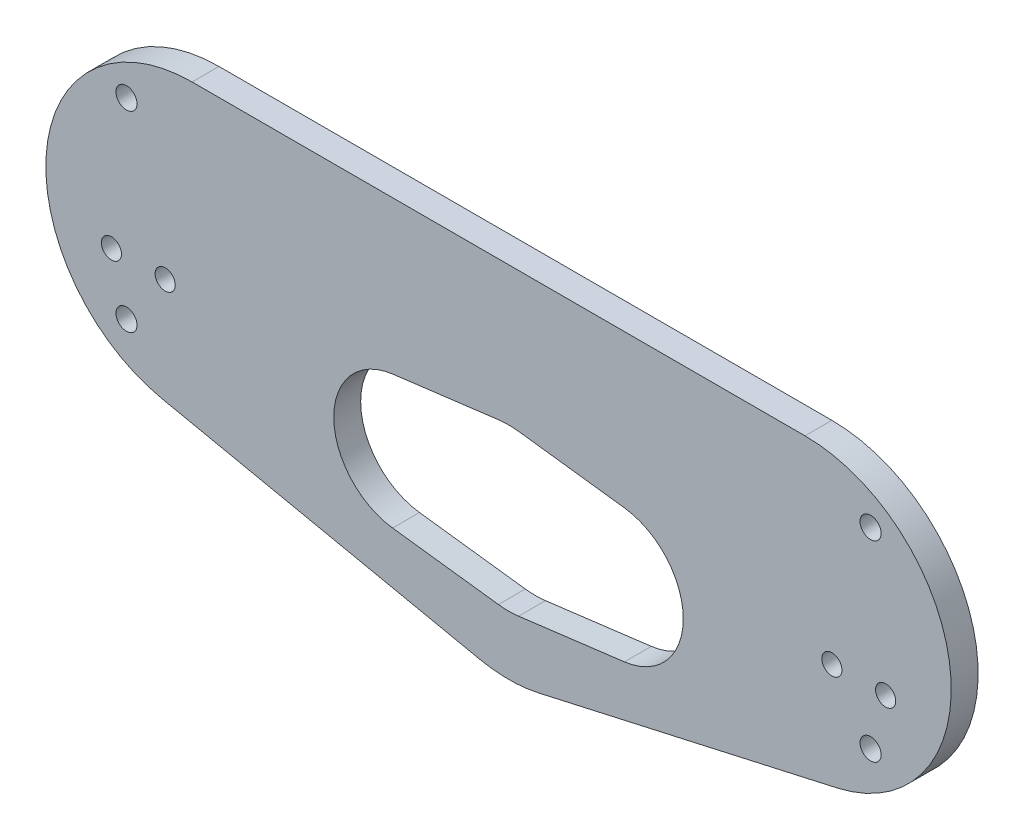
ISO-10303-21;
HEADER;
FILE_DESCRIPTION(('STEP AP214'),'2;1');
FILE_NAME('part.step','',(''),(''),'','','');
FILE_SCHEMA(('AUTOMOTIVE_DESIGN { 1 0 10303 214 1 1 1 1 }'));
ENDSEC;
DATA;
#1=APPLICATION_CONTEXT('core data for automotive mechanical design processes');
#2=APPLICATION_PROTOCOL_DEFINITION('international standard','automotive_design',2000,#1);
#3=PRODUCT_CONTEXT('',#1,'mechanical');
#4=PRODUCT('Part','Part','',(#3));
#5=PRODUCT_RELATED_PRODUCT_CATEGORY('part','',(#4));
#6=PRODUCT_DEFINITION_FORMATION('','',#4);
#7=PRODUCT_DEFINITION_CONTEXT('part definition',#1,'design');
#8=PRODUCT_DEFINITION('design','',#6,#7);
#9=PRODUCT_DEFINITION_SHAPE('','',#8);
#10=(LENGTH_UNIT() NAMED_UNIT(*) SI_UNIT(.MILLI.,.METRE.));
#11=(NAMED_UNIT(*) PLANE_ANGLE_UNIT() SI_UNIT($,.RADIAN.));
#12=(NAMED_UNIT(*) SI_UNIT($,.STERADIAN.) SOLID_ANGLE_UNIT());
#13=UNCERTAINTY_MEASURE_WITH_UNIT(LENGTH_MEASURE(1.E-05),#10,'distance_accuracy_value','');
#14=(GEOMETRIC_REPRESENTATION_CONTEXT(3) GLOBAL_UNCERTAINTY_ASSIGNED_CONTEXT((#13)) GLOBAL_UNIT_ASSIGNED_CONTEXT((#10,
#11,#12)) REPRESENTATION_CONTEXT('',''));
#15=CARTESIAN_POINT('',(0.,0.,0.));
#16=DIRECTION('',(0.,0.,1.));
#17=DIRECTION('',(1.,0.,0.));
#18=AXIS2_PLACEMENT_3D('',#15,#16,#17);
#19=CARTESIAN_POINT('',(66.0400000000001,-1.83880688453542E-13,-6.35));
#20=DIRECTION('',(0.,0.,1.));
#21=DIRECTION('',(1.,0.,0.));
#22=AXIS2_PLACEMENT_3D('',#19,#20,#21);
#23=PLANE('',#22);
#24=DIRECTION('',(-0.998868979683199,0.0475474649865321,0.));
#25=VECTOR('',#24,1.);
#26=CARTESIAN_POINT('',(-0.0170942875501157,-0.359113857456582,-6.35));
#27=LINE('',#26,#25);
#28=CARTESIAN_POINT('',(62.5858978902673,-3.33909785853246,-6.35));
#29=VERTEX_POINT('',#28);
#30=CARTESIAN_POINT('',(43.4028053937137,-2.42595765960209,-6.35));
#31=VERTEX_POINT('',#30);
#32=EDGE_CURVE('E769',#29,#31,#27,.T.);
#33=ORIENTED_EDGE('',*,*,#32,.T.);
#34=CARTESIAN_POINT('',(43.221649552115,-6.23164847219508,-6.35));
#35=DIRECTION('',(0.,0.,1.));
#36=DIRECTION('',(1.,0.,0.));
#37=AXIS2_PLACEMENT_3D('',#34,#35,#36);
#38=CIRCLE('',#37,3.81);
#39=CARTESIAN_POINT('',(39.822278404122,-7.95222273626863,-6.35));
#40=VERTEX_POINT('',#39);
#41=EDGE_CURVE('E1400',#31,#40,#38,.T.);
#42=ORIENTED_EDGE('',*,*,#41,.T.);
#43=CARTESIAN_POINT('',(21.4090180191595,-17.2720000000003,-6.35));
#44=DIRECTION('',(0.,0.,-1.));
#45=DIRECTION('',(-1.,0.,0.));
#46=AXIS2_PLACEMENT_3D('',#43,#44,#45);
#47=CIRCLE('',#46,20.6375);
#48=CARTESIAN_POINT('',(40.1675386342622,-25.8757381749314,-6.35));
#49=VERTEX_POINT('',#48);
#50=EDGE_CURVE('E766',#40,#49,#47,.T.);
#51=ORIENTED_EDGE('',*,*,#50,.T.);
#52=CARTESIAN_POINT('',(45.9393911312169,-28.5230422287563,-6.35));
#53=DIRECTION('',(0.,0.,-1.));
#54=DIRECTION('',(-1.,0.,0.));
#55=AXIS2_PLACEMENT_3D('',#52,#53,#54);
#56=CIRCLE('',#55,6.35);
#57=CARTESIAN_POINT('',(47.3293481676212,-34.7190505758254,-6.35));
#58=VERTEX_POINT('',#57);
#59=EDGE_CURVE('E781',#58,#49,#56,.T.);
#60=ORIENTED_EDGE('',*,*,#59,.F.);
#61=DIRECTION('',(-0.975749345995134,-0.218890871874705,0.));
#62=VECTOR('',#61,1.);
#63=CARTESIAN_POINT('',(9.68308713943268,-43.1642757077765,-6.35));
#64=LINE('',#63,#62);
#65=CARTESIAN_POINT('',(72.4697529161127,-29.0792772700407,-6.35));
#66=VERTEX_POINT('',#65);
#67=EDGE_CURVE('E778',#66,#58,#64,.T.);
#68=ORIENTED_EDGE('',*,*,#67,.F.);
#69=CARTESIAN_POINT('',(71.6357786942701,-25.3616722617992,-6.35));
#70=DIRECTION('',(0.,0.,1.));
#71=DIRECTION('',(1.,0.,0.));
#72=AXIS2_PLACEMENT_3D('',#69,#70,#71);
#73=CIRCLE('',#72,3.81);
#74=CARTESIAN_POINT('',(74.7277245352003,-23.1354712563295,-6.35));
#75=VERTEX_POINT('',#74);
#76=EDGE_CURVE('E1406',#66,#75,#73,.T.);
#77=ORIENTED_EDGE('',*,*,#76,.T.);
#78=DIRECTION('',(0.584304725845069,-0.811534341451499,0.));
#79=VECTOR('',#78,1.);
#80=CARTESIAN_POINT('',(38.2443264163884,27.5359150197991,-6.35));
#81=LINE('',#80,#79);
#82=CARTESIAN_POINT('',(67.236756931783,-12.7313495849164,-6.35));
#83=VERTEX_POINT('',#82);
#84=EDGE_CURVE('E776',#83,#75,#81,.T.);
#85=ORIENTED_EDGE('',*,*,#84,.F.);
#86=CARTESIAN_POINT('',(72.39,-9.02101457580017,-6.35));
#87=DIRECTION('',(0.,0.,-1.));
#88=DIRECTION('',(-1.,0.,0.));
#89=AXIS2_PLACEMENT_3D('',#86,#87,#88);
#90=CIRCLE('',#89,6.35);
#91=CARTESIAN_POINT('',(66.1492137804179,-7.84837338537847,-6.35));
#92=VERTEX_POINT('',#91);
#93=EDGE_CURVE('E732',#83,#92,#90,.T.);
#94=ORIENTED_EDGE('',*,*,#93,.T.);
#95=CARTESIAN_POINT('',(62.4047420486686,-7.14478867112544,-6.35));
#96=DIRECTION('',(0.,0.,1.));
#97=DIRECTION('',(1.,0.,0.));
#98=AXIS2_PLACEMENT_3D('',#95,#96,#97);
#99=CIRCLE('',#98,3.81);
#100=EDGE_CURVE('E1403',#92,#29,#99,.T.);
#101=ORIENTED_EDGE('',*,*,#100,.T.);
#102=EDGE_LOOP('',(#33,#42,#51,#60,#68,#77,#85,#94,#101));
#103=FACE_BOUND('',#102,.T.);
#104=CARTESIAN_POINT('',(-3.99098198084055,-17.2720000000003,-6.35));
#105=DIRECTION('',(0.,0.,-1.));
#106=DIRECTION('',(-1.,0.,0.));
#107=AXIS2_PLACEMENT_3D('',#104,#105,#106);
#108=CIRCLE('',#107,23.8125);
#109=CARTESIAN_POINT('',(-6.96754448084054,6.35373241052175,-6.35));
#110=VERTEX_POINT('',#109);
#111=CARTESIAN_POINT('',(-1.01441948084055,6.35373241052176,-6.35));
#112=VERTEX_POINT('',#111);
#113=EDGE_CURVE('E869',#110,#112,#108,.T.);
#114=ORIENTED_EDGE('',*,*,#113,.T.);
#115=DIRECTION('',(0.992156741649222,-0.125,0.));
#116=VECTOR('',#115,1.);
#117=CARTESIAN_POINT('',(0.772137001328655,6.12864745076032,-6.35));
#118=LINE('',#117,#116);
#119=CARTESIAN_POINT('',(23.0451368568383,3.32251323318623,-6.35));
#120=VERTEX_POINT('',#119);
#121=EDGE_CURVE('E881',#112,#120,#118,.T.);
#122=ORIENTED_EDGE('',*,*,#121,.T.);
#123=CARTESIAN_POINT('',(23.5213868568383,7.10263041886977,-6.35));
#124=DIRECTION('',(0.,0.,1.));
#125=DIRECTION('',(1.,0.,0.));
#126=AXIS2_PLACEMENT_3D('',#123,#124,#125);
#127=CIRCLE('',#126,3.81);
#128=CARTESIAN_POINT('',(23.3402310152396,3.29693960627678,-6.35));
#129=VERTEX_POINT('',#128);
#130=EDGE_CURVE('E209',#120,#129,#127,.T.);
#131=ORIENTED_EDGE('',*,*,#130,.T.);
#132=DIRECTION('',(-0.998868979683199,0.0475474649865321,0.));
#133=VECTOR('',#132,1.);
#134=CARTESIAN_POINT('',(0.209350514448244,4.39799965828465,-6.35));
#135=LINE('',#134,#133);
#136=CARTESIAN_POINT('',(65.3027170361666,1.29947059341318,-6.35));
#137=VERTEX_POINT('',#136);
#138=EDGE_CURVE('E953',#137,#129,#135,.T.);
#139=ORIENTED_EDGE('',*,*,#138,.F.);
#140=CARTESIAN_POINT('',(65.4838728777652,5.10516140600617,-6.35));
#141=DIRECTION('',(0.,0.,1.));
#142=DIRECTION('',(1.,0.,0.));
#143=AXIS2_PLACEMENT_3D('',#140,#141,#142);
#144=CIRCLE('',#143,3.81);
#145=CARTESIAN_POINT('',(68.897851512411,3.41375669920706,-6.35));
#146=VERTEX_POINT('',#145);
#147=EDGE_CURVE('E1435',#137,#146,#144,.T.);
#148=ORIENTED_EDGE('',*,*,#147,.T.);
#149=DIRECTION('',(-0.443938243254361,-0.896057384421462,0.));
#150=VECTOR('',#149,1.);
#151=CARTESIAN_POINT('',(53.9614103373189,-26.7343745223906,-6.35));
#152=LINE('',#151,#150);
#153=CARTESIAN_POINT('',(75.8240377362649,17.393764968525,-6.35));
#154=VERTEX_POINT('',#153);
#155=EDGE_CURVE('E949',#154,#146,#152,.T.);
#156=ORIENTED_EDGE('',*,*,#155,.F.);
#157=CARTESIAN_POINT('',(72.4100591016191,19.0851696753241,-6.35));
#158=DIRECTION('',(0.,0.,1.));
#159=DIRECTION('',(1.,0.,0.));
#160=AXIS2_PLACEMENT_3D('',#157,#158,#159);
#161=CIRCLE('',#160,3.81);
#162=CARTESIAN_POINT('',(75.8315369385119,20.7613526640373,-6.35));
#163=VERTEX_POINT('',#162);
#164=EDGE_CURVE('E1432',#154,#163,#161,.T.);
#165=ORIENTED_EDGE('',*,*,#164,.T.);
#166=CARTESIAN_POINT('',(81.5339999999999,23.5549909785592,-6.35));
#167=DIRECTION('',(0.,0.,-1.));
#168=DIRECTION('',(-1.,0.,0.));
#169=AXIS2_PLACEMENT_3D('',#166,#167,#168);
#170=CIRCLE('',#169,6.35);
#171=CARTESIAN_POINT('',(75.2875709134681,24.6971922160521,-6.35));
#172=VERTEX_POINT('',#171);
#173=EDGE_CURVE('E946',#163,#172,#170,.T.);
#174=ORIENTED_EDGE('',*,*,#173,.T.);
#175=CARTESIAN_POINT('',(71.5397134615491,25.3825129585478,-6.35));
#176=DIRECTION('',(0.,0.,1.));
#177=DIRECTION('',(1.,0.,0.));
#178=AXIS2_PLACEMENT_3D('',#175,#176,#177);
#179=CIRCLE('',#178,3.81);
#180=CARTESIAN_POINT('',(72.3465173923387,29.1061089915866,-6.35));
#181=VERTEX_POINT('',#180);
#182=EDGE_CURVE('E12',#172,#181,#179,.T.);
#183=ORIENTED_EDGE('',*,*,#182,.T.);
#184=CARTESIAN_POINT('',(66.0400000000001,-1.83880688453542E-13,-6.35));
#185=DIRECTION('',(0.,0.,-1.));
#186=DIRECTION('',(-1.,0.,0.));
#187=AXIS2_PLACEMENT_3D('',#184,#185,#186);
#188=CIRCLE('',#187,29.7815);
#189=CARTESIAN_POINT('',(66.0400000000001,29.7814999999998,-6.35));
#190=VERTEX_POINT('',#189);
#191=EDGE_CURVE('E943',#190,#181,#188,.T.);
#192=ORIENTED_EDGE('',*,*,#191,.F.);
#193=DIRECTION('',(1.,0.,0.));
#194=VECTOR('',#193,1.);
#195=CARTESIAN_POINT('',(0.,29.7814999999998,-6.35));
#196=LINE('',#195,#194);
#197=CARTESIAN_POINT('',(-78.7399999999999,29.7814999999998,-6.35));
#198=VERTEX_POINT('',#197);
#199=EDGE_CURVE('E939',#198,#190,#196,.T.);
#200=ORIENTED_EDGE('',*,*,#199,.F.);
#201=CARTESIAN_POINT('',(-78.7399999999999,-1.94289029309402E-13,-6.35));
#202=DIRECTION('',(0.,0.,-1.));
#203=DIRECTION('',(-1.,0.,0.));
#204=AXIS2_PLACEMENT_3D('',#201,#202,#203);
#205=CIRCLE('',#204,29.7815);
#206=CARTESIAN_POINT('',(-85.0465173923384,29.1061089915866,-6.35));
#207=VERTEX_POINT('',#206);
#208=EDGE_CURVE('E937',#207,#198,#205,.T.);
#209=ORIENTED_EDGE('',*,*,#208,.F.);
#210=CARTESIAN_POINT('',(-84.2397134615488,25.3825129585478,-6.35));
#211=DIRECTION('',(0.,0.,1.));
#212=DIRECTION('',(1.,0.,0.));
#213=AXIS2_PLACEMENT_3D('',#210,#211,#212);
#214=CIRCLE('',#213,3.81);
#215=CARTESIAN_POINT('',(-87.9875709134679,24.6971922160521,-6.35));
#216=VERTEX_POINT('',#215);
#217=EDGE_CURVE('E1430',#207,#216,#214,.T.);
#218=ORIENTED_EDGE('',*,*,#217,.T.);
#219=CARTESIAN_POINT('',(-94.2339999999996,23.5549909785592,-6.35));
#220=DIRECTION('',(0.,0.,-1.));
#221=DIRECTION('',(-1.,0.,0.));
#222=AXIS2_PLACEMENT_3D('',#219,#220,#221);
#223=CIRCLE('',#222,6.35);
#224=CARTESIAN_POINT('',(-88.5315369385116,20.7613526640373,-6.35));
#225=VERTEX_POINT('',#224);
#226=EDGE_CURVE('E934',#225,#216,#223,.F.);
#227=ORIENTED_EDGE('',*,*,#226,.F.);
#228=CARTESIAN_POINT('',(-85.1100591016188,19.0851696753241,-6.35));
#229=DIRECTION('',(0.,0.,1.));
#230=DIRECTION('',(1.,0.,0.));
#231=AXIS2_PLACEMENT_3D('',#228,#229,#230);
#232=CIRCLE('',#231,3.81);
#233=CARTESIAN_POINT('',(-88.5240377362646,17.393764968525,-6.35));
#234=VERTEX_POINT('',#233);
#235=EDGE_CURVE('E1428',#225,#234,#232,.T.);
#236=ORIENTED_EDGE('',*,*,#235,.T.);
#237=DIRECTION('',(0.443938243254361,-0.896057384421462,0.));
#238=VECTOR('',#237,1.);
#239=CARTESIAN_POINT('',(-64.1584795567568,-31.7863601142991,-6.35));
#240=LINE('',#239,#238);
#241=CARTESIAN_POINT('',(-81.5978515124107,3.41375669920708,-6.35));
#242=VERTEX_POINT('',#241);
#243=EDGE_CURVE('E930',#234,#242,#240,.T.);
#244=ORIENTED_EDGE('',*,*,#243,.T.);
#245=CARTESIAN_POINT('',(-78.1838728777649,5.10516140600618,-6.35));
#246=DIRECTION('',(0.,0.,1.));
#247=DIRECTION('',(1.,0.,0.));
#248=AXIS2_PLACEMENT_3D('',#245,#246,#247);
#249=CIRCLE('',#248,3.81);
#250=CARTESIAN_POINT('',(-78.0027170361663,1.29947059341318,-6.35));
#251=VERTEX_POINT('',#250);
#252=EDGE_CURVE('E1425',#242,#251,#249,.T.);
#253=ORIENTED_EDGE('',*,*,#252,.T.);
#254=DIRECTION('',(0.998868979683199,0.0475474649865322,0.));
#255=VECTOR('',#254,1.);
#256=CARTESIAN_POINT('',(-0.238062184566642,5.00116949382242,-6.35));
#257=LINE('',#256,#255);
#258=CARTESIAN_POINT('',(-28.4571142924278,3.65790584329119,-6.35));
#259=VERTEX_POINT('',#258);
#260=EDGE_CURVE('E926',#251,#259,#257,.T.);
#261=ORIENTED_EDGE('',*,*,#260,.T.);
#262=CARTESIAN_POINT('',(-28.6382701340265,7.46359665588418,-6.35));
#263=DIRECTION('',(0.,0.,1.));
#264=DIRECTION('',(1.,0.,0.));
#265=AXIS2_PLACEMENT_3D('',#262,#263,#264);
#266=CIRCLE('',#265,3.81);
#267=CARTESIAN_POINT('',(-28.1620201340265,3.68347947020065,-6.35));
#268=VERTEX_POINT('',#267);
#269=EDGE_CURVE('E1422',#259,#268,#266,.T.);
#270=ORIENTED_EDGE('',*,*,#269,.T.);
#271=DIRECTION('',(0.992156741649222,0.125,0.));
#272=VECTOR('',#271,1.);
#273=CARTESIAN_POINT('',(-0.896855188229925,7.1185673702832,-6.35));
#274=LINE('',#273,#272);
#275=EDGE_CURVE('E923',#268,#110,#274,.T.);
#276=ORIENTED_EDGE('',*,*,#275,.T.);
#277=EDGE_LOOP('',(#114,#122,#131,#139,#148,#156,#165,#174,#183,#192,#200,#209,#218,#227,#236,
#244,#253,#261,#270,#276));
#278=FACE_BOUND('',#277,.T.);
#279=CARTESIAN_POINT('',(-29.3909819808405,-17.2720000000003,-6.35));
#280=DIRECTION('',(0.,0.,1.));
#281=DIRECTION('',(1.,0.,0.));
#282=AXIS2_PLACEMENT_3D('',#279,#280,#281);
#283=CIRCLE('',#282,15.875);
#284=CARTESIAN_POINT('',(-31.3753569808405,-1.52151172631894,-6.35));
#285=VERTEX_POINT('',#284);
#286=CARTESIAN_POINT('',(-31.3753569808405,-33.0224882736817,-6.35));
#287=VERTEX_POINT('',#286);
#288=EDGE_CURVE('E999',#285,#287,#283,.T.);
#289=ORIENTED_EDGE('',*,*,#288,.T.);
#290=DIRECTION('',(0.992156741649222,-0.125,0.));
#291=VECTOR('',#290,1.);
#292=CARTESIAN_POINT('',(-4.58567549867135,-36.3976708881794,-6.35));
#293=LINE('',#292,#291);
#294=CARTESIAN_POINT('',(-6.37223198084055,-36.172585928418,-6.35));
#295=VERTEX_POINT('',#294);
#296=EDGE_CURVE('E974',#287,#295,#293,.T.);
#297=ORIENTED_EDGE('',*,*,#296,.T.);
#298=CARTESIAN_POINT('',(-3.99098198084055,-17.2720000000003,-6.35));
#299=DIRECTION('',(0.,0.,1.));
#300=DIRECTION('',(1.,0.,0.));
#301=AXIS2_PLACEMENT_3D('',#298,#299,#300);
#302=CIRCLE('',#301,19.05);
#303=CARTESIAN_POINT('',(-1.60973198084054,-36.172585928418,-6.35));
#304=VERTEX_POINT('',#303);
#305=EDGE_CURVE('E977',#295,#304,#302,.T.);
#306=ORIENTED_EDGE('',*,*,#305,.T.);
#307=DIRECTION('',(-0.992156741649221,-0.125,0.));
#308=VECTOR('',#307,1.);
#309=CARTESIAN_POINT('',(4.46095731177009,-35.4077509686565,-6.35));
#310=LINE('',#309,#308);
#311=CARTESIAN_POINT('',(23.3933930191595,-33.0224882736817,-6.35));
#312=VERTEX_POINT('',#311);
#313=EDGE_CURVE('E982',#312,#304,#310,.T.);
#314=ORIENTED_EDGE('',*,*,#313,.F.);
#315=CARTESIAN_POINT('',(21.4090180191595,-17.2720000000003,-6.35));
#316=DIRECTION('',(0.,0.,1.));
#317=DIRECTION('',(1.,0.,0.));
#318=AXIS2_PLACEMENT_3D('',#315,#316,#317);
#319=CIRCLE('',#318,15.875);
#320=CARTESIAN_POINT('',(23.3933930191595,-1.52151172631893,-6.35));
#321=VERTEX_POINT('',#320);
#322=EDGE_CURVE('E986',#312,#321,#319,.T.);
#323=ORIENTED_EDGE('',*,*,#322,.T.);
#324=DIRECTION('',(0.992156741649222,-0.125,0.));
#325=VECTOR('',#324,1.);
#326=CARTESIAN_POINT('',(0.176824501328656,1.40350096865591,-6.35));
#327=LINE('',#326,#325);
#328=CARTESIAN_POINT('',(-1.60973198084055,1.62858592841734,-6.35));
#329=VERTEX_POINT('',#328);
#330=EDGE_CURVE('E990',#329,#321,#327,.T.);
#331=ORIENTED_EDGE('',*,*,#330,.F.);
#332=CARTESIAN_POINT('',(-3.99098198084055,-17.2720000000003,-6.35));
#333=DIRECTION('',(0.,0.,1.));
#334=DIRECTION('',(1.,0.,0.));
#335=AXIS2_PLACEMENT_3D('',#332,#333,#334);
#336=CIRCLE('',#335,19.05);
#337=CARTESIAN_POINT('',(-6.37223198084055,1.62858592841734,-6.35));
#338=VERTEX_POINT('',#337);
#339=EDGE_CURVE('E993',#329,#338,#336,.T.);
#340=ORIENTED_EDGE('',*,*,#339,.T.);
#341=DIRECTION('',(0.992156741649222,0.125,0.));
#342=VECTOR('',#341,1.);
#343=CARTESIAN_POINT('',(-0.301542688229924,2.39342088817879,-6.35));
#344=LINE('',#343,#342);
#345=EDGE_CURVE('E996',#285,#338,#344,.T.);
#346=ORIENTED_EDGE('',*,*,#345,.F.);
#347=EDGE_LOOP('',(#289,#297,#306,#314,#323,#331,#340,#346));
#348=FACE_BOUND('',#347,.T.);
#349=CARTESIAN_POINT('',(81.5339999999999,-21.7210145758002,-6.35));
#350=DIRECTION('',(0.,0.,1.));
#351=DIRECTION('',(1.,0.,0.));
#352=AXIS2_PLACEMENT_3D('',#349,#350,#351);
#353=CIRCLE('',#352,2.4892);
#354=CARTESIAN_POINT('',(84.0231999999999,-21.7210145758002,-6.35));
#355=VERTEX_POINT('',#354);
#356=EDGE_CURVE('E1054',#355,#355,#353,.T.);
#357=ORIENTED_EDGE('',*,*,#356,.T.);
#358=EDGE_LOOP('',(#357));
#359=FACE_BOUND('',#358,.T.);
#360=CARTESIAN_POINT('',(85.09,-9.02101457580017,-6.35));
#361=DIRECTION('',(0.,0.,1.));
#362=DIRECTION('',(1.,0.,0.));
#363=AXIS2_PLACEMENT_3D('',#360,#361,#362);
#364=CIRCLE('',#363,2.38125000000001);
#365=CARTESIAN_POINT('',(87.47125,-9.02101457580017,-6.35));
#366=VERTEX_POINT('',#365);
#367=EDGE_CURVE('E1062',#366,#366,#364,.T.);
#368=ORIENTED_EDGE('',*,*,#367,.T.);
#369=EDGE_LOOP('',(#368));
#370=FACE_BOUND('',#369,.T.);
#371=CARTESIAN_POINT('',(72.39,-9.02101457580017,-6.35));
#372=DIRECTION('',(0.,0.,1.));
#373=DIRECTION('',(1.,0.,0.));
#374=AXIS2_PLACEMENT_3D('',#371,#372,#373);
#375=CIRCLE('',#374,2.38125000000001);
#376=CARTESIAN_POINT('',(74.77125,-9.02101457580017,-6.35));
#377=VERTEX_POINT('',#376);
#378=EDGE_CURVE('E1070',#377,#377,#375,.T.);
#379=ORIENTED_EDGE('',*,*,#378,.T.);
#380=EDGE_LOOP('',(#379));
#381=FACE_BOUND('',#380,.T.);
#382=CARTESIAN_POINT('',(81.5339999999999,23.5549909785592,-6.35));
#383=DIRECTION('',(0.,0.,1.));
#384=DIRECTION('',(1.,0.,0.));
#385=AXIS2_PLACEMENT_3D('',#382,#383,#384);
#386=CIRCLE('',#385,2.4892);
#387=CARTESIAN_POINT('',(84.0231999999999,23.5549909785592,-6.35));
#388=VERTEX_POINT('',#387);
#389=EDGE_CURVE('E1078',#388,#388,#386,.T.);
#390=ORIENTED_EDGE('',*,*,#389,.T.);
#391=EDGE_LOOP('',(#390));
#392=FACE_BOUND('',#391,.T.);
#393=CARTESIAN_POINT('',(-94.2339999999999,23.5549909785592,-6.35));
#394=DIRECTION('',(0.,0.,1.));
#395=DIRECTION('',(1.,0.,0.));
#396=AXIS2_PLACEMENT_3D('',#393,#394,#395);
#397=CIRCLE('',#396,2.4892);
#398=CARTESIAN_POINT('',(-91.7447999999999,23.5549909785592,-6.35));
#399=VERTEX_POINT('',#398);
#400=EDGE_CURVE('E1086',#399,#399,#397,.T.);
#401=ORIENTED_EDGE('',*,*,#400,.T.);
#402=EDGE_LOOP('',(#401));
#403=FACE_BOUND('',#402,.T.);
#404=CARTESIAN_POINT('',(-85.09,-9.02101457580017,-6.35));
#405=DIRECTION('',(0.,0.,1.));
#406=DIRECTION('',(1.,0.,0.));
#407=AXIS2_PLACEMENT_3D('',#404,#405,#406);
#408=CIRCLE('',#407,2.38125000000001);
#409=CARTESIAN_POINT('',(-82.70875,-9.02101457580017,-6.35));
#410=VERTEX_POINT('',#409);
#411=EDGE_CURVE('E1092',#410,#410,#408,.T.);
#412=ORIENTED_EDGE('',*,*,#411,.T.);
#413=EDGE_LOOP('',(#412));
#414=FACE_BOUND('',#413,.T.);
#415=CARTESIAN_POINT('',(-97.79,-9.02101457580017,-6.35));
#416=DIRECTION('',(0.,0.,1.));
#417=DIRECTION('',(1.,0.,0.));
#418=AXIS2_PLACEMENT_3D('',#415,#416,#417);
#419=CIRCLE('',#418,2.38125000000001);
#420=CARTESIAN_POINT('',(-95.40875,-9.02101457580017,-6.35));
#421=VERTEX_POINT('',#420);
#422=EDGE_CURVE('E1100',#421,#421,#419,.T.);
#423=ORIENTED_EDGE('',*,*,#422,.T.);
#424=EDGE_LOOP('',(#423));
#425=FACE_BOUND('',#424,.T.);
#426=CARTESIAN_POINT('',(-94.2339999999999,-21.7210145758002,-6.35));
#427=DIRECTION('',(0.,0.,1.));
#428=DIRECTION('',(1.,0.,0.));
#429=AXIS2_PLACEMENT_3D('',#426,#427,#428);
#430=CIRCLE('',#429,2.4892);
#431=CARTESIAN_POINT('',(-91.7447999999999,-21.7210145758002,-6.35));
#432=VERTEX_POINT('',#431);
#433=EDGE_CURVE('E1107',#432,#432,#430,.T.);
#434=ORIENTED_EDGE('',*,*,#433,.T.);
#435=EDGE_LOOP('',(#434));
#436=FACE_BOUND('',#435,.T.);
#437=CARTESIAN_POINT('',(66.0400000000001,-1.83880688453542E-13,-6.35));
#438=DIRECTION('',(0.,0.,1.));
#439=DIRECTION('',(1.,0.,0.));
#440=AXIS2_PLACEMENT_3D('',#437,#438,#439);
#441=CIRCLE('',#440,34.544);
#442=CARTESIAN_POINT('',(73.6013662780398,-33.7062854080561,-6.35));
#443=VERTEX_POINT('',#442);
#444=CARTESIAN_POINT('',(66.0400000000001,34.5439999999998,-6.35));
#445=VERTEX_POINT('',#444);
#446=EDGE_CURVE('E1115',#443,#445,#441,.T.);
#447=ORIENTED_EDGE('',*,*,#446,.F.);
#448=DIRECTION('',(0.975749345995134,0.218890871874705,0.));
#449=VECTOR('',#448,1.);
#450=CARTESIAN_POINT('',(3.23679460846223,-49.4912434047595,-6.35));
#451=LINE('',#450,#449);
#452=CARTESIAN_POINT('',(3.23679460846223,-49.4912434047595,-6.35));
#453=VERTEX_POINT('',#452);
#454=EDGE_CURVE('E1134',#453,#443,#451,.T.);
#455=ORIENTED_EDGE('',*,*,#454,.F.);
#456=CARTESIAN_POINT('',(-3.99098198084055,-17.2720000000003,-6.35));
#457=DIRECTION('',(0.,0.,1.));
#458=DIRECTION('',(1.,0.,0.));
#459=AXIS2_PLACEMENT_3D('',#456,#457,#458);
#460=CIRCLE('',#459,33.0199999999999);
#461=CARTESIAN_POINT('',(-10.7843616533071,-49.5856254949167,-6.35));
#462=VERTEX_POINT('',#461);
#463=EDGE_CURVE('E1131',#462,#453,#460,.T.);
#464=ORIENTED_EDGE('',*,*,#463,.F.);
#465=DIRECTION('',(0.978607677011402,-0.20573530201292,0.));
#466=VECTOR('',#465,1.);
#467=CARTESIAN_POINT('',(-85.8469202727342,-33.8050235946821,-6.35));
#468=LINE('',#467,#466);
#469=CARTESIAN_POINT('',(-85.8469202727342,-33.8050235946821,-6.35));
#470=VERTEX_POINT('',#469);
#471=EDGE_CURVE('E1128',#470,#462,#468,.T.);
#472=ORIENTED_EDGE('',*,*,#471,.F.);
#473=CARTESIAN_POINT('',(-78.7399999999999,-1.94289029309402E-13,-6.35));
#474=DIRECTION('',(0.,0.,1.));
#475=DIRECTION('',(1.,0.,0.));
#476=AXIS2_PLACEMENT_3D('',#473,#474,#475);
#477=CIRCLE('',#476,34.544);
#478=CARTESIAN_POINT('',(-78.7399999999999,34.5439999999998,-6.35));
#479=VERTEX_POINT('',#478);
#480=EDGE_CURVE('E1124',#479,#470,#477,.T.);
#481=ORIENTED_EDGE('',*,*,#480,.F.);
#482=DIRECTION('',(-1.,0.,0.));
#483=VECTOR('',#482,1.);
#484=CARTESIAN_POINT('',(66.0400000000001,34.5439999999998,-6.35));
#485=LINE('',#484,#483);
#486=EDGE_CURVE('E1119',#445,#479,#485,.T.);
#487=ORIENTED_EDGE('',*,*,#486,.F.);
#488=EDGE_LOOP('',(#447,#455,#464,#472,#481,#487));
#489=FACE_BOUND('',#488,.T.);
#490=CARTESIAN_POINT('',(-78.7399999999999,-1.94289029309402E-13,-6.35));
#491=DIRECTION('',(0.,0.,-1.));
#492=DIRECTION('',(-1.,0.,0.));
#493=AXIS2_PLACEMENT_3D('',#490,#491,#492);
#494=CIRCLE('',#493,29.7815);
#495=CARTESIAN_POINT('',(-84.8671058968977,-29.1444045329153,-6.35));
#496=VERTEX_POINT('',#495);
#497=CARTESIAN_POINT('',(-85.1565580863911,-29.0820481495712,-6.35));
#498=VERTEX_POINT('',#497);
#499=EDGE_CURVE('E845',#496,#498,#494,.T.);
#500=ORIENTED_EDGE('',*,*,#499,.F.);
#501=DIRECTION('',(-0.978607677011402,0.20573530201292,0.));
#502=VECTOR('',#501,1.);
#503=CARTESIAN_POINT('',(-9.4599350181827,-44.997455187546,-6.35));
#504=LINE('',#503,#502);
#505=CARTESIAN_POINT('',(-58.6222439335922,-34.6619318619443,-6.35));
#506=VERTEX_POINT('',#505);
#507=EDGE_CURVE('E804',#506,#496,#504,.T.);
#508=ORIENTED_EDGE('',*,*,#507,.F.);
#509=CARTESIAN_POINT('',(-57.8383924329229,-30.9334366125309,-6.35));
#510=DIRECTION('',(0.,0.,1.));
#511=DIRECTION('',(1.,0.,0.));
#512=AXIS2_PLACEMENT_3D('',#509,#510,#511);
#513=CIRCLE('',#512,3.81);
#514=CARTESIAN_POINT('',(-56.6368943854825,-34.5490281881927,-6.35));
#515=VERTEX_POINT('',#514);
#516=EDGE_CURVE('E1417',#506,#515,#513,.T.);
#517=ORIENTED_EDGE('',*,*,#516,.T.);
#518=CARTESIAN_POINT('',(-58.6393911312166,-28.5230422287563,-6.35));
#519=DIRECTION('',(0.,0.,-1.));
#520=DIRECTION('',(-1.,0.,0.));
#521=AXIS2_PLACEMENT_3D('',#518,#519,#520);
#522=CIRCLE('',#521,6.35);
#523=CARTESIAN_POINT('',(-52.8675386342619,-25.8757381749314,-6.35));
#524=VERTEX_POINT('',#523);
#525=EDGE_CURVE('E820',#515,#524,#522,.F.);
#526=ORIENTED_EDGE('',*,*,#525,.T.);
#527=CARTESIAN_POINT('',(-34.1090180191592,-17.2720000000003,-6.35));
#528=DIRECTION('',(0.,0.,-1.));
#529=DIRECTION('',(-1.,0.,0.));
#530=AXIS2_PLACEMENT_3D('',#527,#528,#529);
#531=CIRCLE('',#530,20.6375);
#532=CARTESIAN_POINT('',(-52.5222784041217,-7.95222273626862,-6.35));
#533=VERTEX_POINT('',#532);
#534=EDGE_CURVE('E861',#533,#524,#531,.F.);
#535=ORIENTED_EDGE('',*,*,#534,.F.);
#536=CARTESIAN_POINT('',(-55.9216495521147,-6.23164847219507,-6.35));
#537=DIRECTION('',(0.,0.,1.));
#538=DIRECTION('',(1.,0.,0.));
#539=AXIS2_PLACEMENT_3D('',#536,#537,#538);
#540=CIRCLE('',#539,3.81);
#541=CARTESIAN_POINT('',(-56.1028053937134,-2.42595765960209,-6.35));
#542=VERTEX_POINT('',#541);
#543=EDGE_CURVE('E1414',#533,#542,#540,.T.);
#544=ORIENTED_EDGE('',*,*,#543,.T.);
#545=DIRECTION('',(0.998868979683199,0.0475474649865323,0.));
#546=VECTOR('',#545,1.);
#547=CARTESIAN_POINT('',(-0.0116173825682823,0.244055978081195,-6.35));
#548=LINE('',#547,#546);
#549=CARTESIAN_POINT('',(-75.285897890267,-3.33909785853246,-6.35));
#550=VERTEX_POINT('',#549);
#551=EDGE_CURVE('E857',#550,#542,#548,.T.);
#552=ORIENTED_EDGE('',*,*,#551,.F.);
#553=CARTESIAN_POINT('',(-75.1047420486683,-7.14478867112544,-6.35));
#554=DIRECTION('',(0.,0.,1.));
#555=DIRECTION('',(1.,0.,0.));
#556=AXIS2_PLACEMENT_3D('',#553,#554,#555);
#557=CIRCLE('',#556,3.81);
#558=CARTESIAN_POINT('',(-78.8492137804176,-7.84837338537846,-6.35));
#559=VERTEX_POINT('',#558);
#560=EDGE_CURVE('E1419',#550,#559,#557,.T.);
#561=ORIENTED_EDGE('',*,*,#560,.T.);
#562=CARTESIAN_POINT('',(-85.0899999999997,-9.02101457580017,-6.35));
#563=DIRECTION('',(0.,0.,-1.));
#564=DIRECTION('',(-1.,0.,0.));
#565=AXIS2_PLACEMENT_3D('',#562,#563,#564);
#566=CIRCLE('',#565,6.35);
#567=CARTESIAN_POINT('',(-79.9367569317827,-12.7313495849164,-6.35));
#568=VERTEX_POINT('',#567);
#569=EDGE_CURVE('E853',#568,#559,#566,.F.);
#570=ORIENTED_EDGE('',*,*,#569,.F.);
#571=DIRECTION('',(-0.584304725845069,-0.811534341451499,0.));
#572=VECTOR('',#571,1.);
#573=CARTESIAN_POINT('',(-46.6083938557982,33.5580435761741,-6.35));
#574=LINE('',#573,#572);
#575=CARTESIAN_POINT('',(-87.4276222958,-23.1353292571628,-6.35));
#576=VERTEX_POINT('',#575);
#577=EDGE_CURVE('E849',#568,#576,#574,.T.);
#578=ORIENTED_EDGE('',*,*,#577,.T.);
#579=CARTESIAN_POINT('',(-84.3356764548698,-25.3615302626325,-6.35));
#580=DIRECTION('',(0.,0.,1.));
#581=DIRECTION('',(1.,0.,0.));
#582=AXIS2_PLACEMENT_3D('',#579,#580,#581);
#583=CIRCLE('',#582,3.81);
#584=EDGE_CURVE('E1411',#576,#498,#583,.T.);
#585=ORIENTED_EDGE('',*,*,#584,.T.);
#586=EDGE_LOOP('',(#500,#508,#517,#526,#535,#544,#552,#561,#570,#578,#585));
#587=FACE_BOUND('',#586,.T.);
#588=CARTESIAN_POINT('',(-78.7399999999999,-1.94289029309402E-13,-6.35));
#589=DIRECTION('',(0.,0.,-1.));
#590=DIRECTION('',(-1.,0.,0.));
#591=AXIS2_PLACEMENT_3D('',#588,#589,#590);
#592=CIRCLE('',#591,29.7815);
#593=CARTESIAN_POINT('',(-108.492847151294,1.30607375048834,-6.35));
#594=VERTEX_POINT('',#593);
#595=CARTESIAN_POINT('',(-102.969496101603,17.3167335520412,-6.35));
#596=VERTEX_POINT('',#595);
#597=EDGE_CURVE('E808',#594,#596,#592,.T.);
#598=ORIENTED_EDGE('',*,*,#597,.F.);
#599=CARTESIAN_POINT('',(-104.686512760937,1.13898542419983,-6.35));
#600=DIRECTION('',(0.,0.,1.));
#601=DIRECTION('',(1.,0.,0.));
#602=AXIS2_PLACEMENT_3D('',#599,#600,#601);
#603=CIRCLE('',#602,3.81);
#604=CARTESIAN_POINT('',(-104.686512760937,-2.67101457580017,-6.35));
#605=VERTEX_POINT('',#604);
#606=EDGE_CURVE('E1393',#594,#605,#603,.T.);
#607=ORIENTED_EDGE('',*,*,#606,.T.);
#608=DIRECTION('',(1.,0.,0.));
#609=VECTOR('',#608,1.);
#610=CARTESIAN_POINT('',(0.,-2.67101457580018,-6.35));
#611=LINE('',#610,#609);
#612=CARTESIAN_POINT('',(-90.0377596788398,-2.67101457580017,-6.35));
#613=VERTEX_POINT('',#612);
#614=EDGE_CURVE('E788',#605,#613,#611,.T.);
#615=ORIENTED_EDGE('',*,*,#614,.T.);
#616=CARTESIAN_POINT('',(-90.0377596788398,1.13898542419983,-6.35));
#617=DIRECTION('',(0.,0.,1.));
#618=DIRECTION('',(1.,0.,0.));
#619=AXIS2_PLACEMENT_3D('',#616,#617,#618);
#620=CIRCLE('',#619,3.81);
#621=CARTESIAN_POINT('',(-86.6237810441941,2.83039013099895,-6.35));
#622=VERTEX_POINT('',#621);
#623=EDGE_CURVE('E1397',#613,#622,#620,.T.);
#624=ORIENTED_EDGE('',*,*,#623,.T.);
#625=DIRECTION('',(0.443938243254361,-0.896057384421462,0.));
#626=VECTOR('',#625,1.);
#627=CARTESIAN_POINT('',(-68.4259528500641,-33.9006159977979,-6.35));
#628=LINE('',#627,#626);
#629=CARTESIAN_POINT('',(-92.7915110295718,15.2795090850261,-6.35));
#630=VERTEX_POINT('',#629);
#631=EDGE_CURVE('E795',#630,#622,#628,.T.);
#632=ORIENTED_EDGE('',*,*,#631,.F.);
#633=CARTESIAN_POINT('',(-96.2054896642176,13.588104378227,-6.35));
#634=DIRECTION('',(0.,0.,1.));
#635=DIRECTION('',(1.,0.,0.));
#636=AXIS2_PLACEMENT_3D('',#633,#634,#635);
#637=CIRCLE('',#636,3.81);
#638=CARTESIAN_POINT('',(-95.4661810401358,17.3256868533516,-6.35));
#639=VERTEX_POINT('',#638);
#640=EDGE_CURVE('E1395',#630,#639,#637,.T.);
#641=ORIENTED_EDGE('',*,*,#640,.T.);
#642=CARTESIAN_POINT('',(-94.2339999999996,23.5549909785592,-6.35));
#643=DIRECTION('',(0.,0.,-1.));
#644=DIRECTION('',(-1.,0.,0.));
#645=AXIS2_PLACEMENT_3D('',#642,#643,#644);
#646=CIRCLE('',#645,6.35);
#647=CARTESIAN_POINT('',(-97.7563586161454,18.2714798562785,-6.35));
#648=VERTEX_POINT('',#647);
#649=EDGE_CURVE('E811',#648,#639,#646,.F.);
#650=ORIENTED_EDGE('',*,*,#649,.F.);
#651=CARTESIAN_POINT('',(-99.8697737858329,15.1013731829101,-6.35));
#652=DIRECTION('',(0.,0.,1.));
#653=DIRECTION('',(1.,0.,0.));
#654=AXIS2_PLACEMENT_3D('',#651,#652,#653);
#655=CIRCLE('',#654,3.81);
#656=EDGE_CURVE('E1409',#648,#596,#655,.T.);
#657=ORIENTED_EDGE('',*,*,#656,.T.);
#658=EDGE_LOOP('',(#598,#607,#615,#624,#632,#641,#650,#657));
#659=FACE_BOUND('',#658,.T.);
#660=CARTESIAN_POINT('',(66.0400000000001,-1.83880688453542E-13,-6.35));
#661=DIRECTION('',(0.,0.,-1.));
#662=DIRECTION('',(-1.,0.,0.));
#663=AXIS2_PLACEMENT_3D('',#660,#661,#662);
#664=CIRCLE('',#663,29.7815);
#665=CARTESIAN_POINT('',(90.2694961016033,17.3167335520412,-6.35));
#666=VERTEX_POINT('',#665);
#667=CARTESIAN_POINT('',(95.7928471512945,1.30607375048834,-6.35));
#668=VERTEX_POINT('',#667);
#669=EDGE_CURVE('E2208',#666,#668,#664,.T.);
#670=ORIENTED_EDGE('',*,*,#669,.F.);
#671=CARTESIAN_POINT('',(87.1697737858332,15.1013731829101,-6.35));
#672=DIRECTION('',(0.,0.,1.));
#673=DIRECTION('',(1.,0.,0.));
#674=AXIS2_PLACEMENT_3D('',#671,#672,#673);
#675=CIRCLE('',#674,3.81);
#676=CARTESIAN_POINT('',(85.0563586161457,18.2714798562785,-6.35));
#677=VERTEX_POINT('',#676);
#678=EDGE_CURVE('E1381',#666,#677,#675,.T.);
#679=ORIENTED_EDGE('',*,*,#678,.T.);
#680=CARTESIAN_POINT('',(81.5339999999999,23.5549909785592,-6.35));
#681=DIRECTION('',(0.,0.,-1.));
#682=DIRECTION('',(-1.,0.,0.));
#683=AXIS2_PLACEMENT_3D('',#680,#681,#682);
#684=CIRCLE('',#683,6.35);
#685=CARTESIAN_POINT('',(82.7661810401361,17.3256868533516,-6.35));
#686=VERTEX_POINT('',#685);
#687=EDGE_CURVE('E2215',#677,#686,#684,.T.);
#688=ORIENTED_EDGE('',*,*,#687,.T.);
#689=CARTESIAN_POINT('',(83.5054896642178,13.588104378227,-6.35));
#690=DIRECTION('',(0.,0.,1.));
#691=DIRECTION('',(1.,0.,0.));
#692=AXIS2_PLACEMENT_3D('',#689,#690,#691);
#693=CIRCLE('',#692,3.81);
#694=CARTESIAN_POINT('',(80.0915110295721,15.2795090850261,-6.35));
#695=VERTEX_POINT('',#694);
#696=EDGE_CURVE('E1390',#686,#695,#693,.T.);
#697=ORIENTED_EDGE('',*,*,#696,.T.);
#698=DIRECTION('',(-0.443938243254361,-0.896057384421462,0.));
#699=VECTOR('',#698,1.);
#700=CARTESIAN_POINT('',(58.2288836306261,-28.8486304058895,-6.35));
#701=LINE('',#700,#699);
#702=CARTESIAN_POINT('',(73.9237810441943,2.83039013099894,-6.35));
#703=VERTEX_POINT('',#702);
#704=EDGE_CURVE('E2219',#695,#703,#701,.T.);
#705=ORIENTED_EDGE('',*,*,#704,.T.);
#706=CARTESIAN_POINT('',(77.3377596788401,1.13898542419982,-6.35));
#707=DIRECTION('',(0.,0.,1.));
#708=DIRECTION('',(1.,0.,0.));
#709=AXIS2_PLACEMENT_3D('',#706,#707,#708);
#710=CIRCLE('',#709,3.81);
#711=CARTESIAN_POINT('',(77.3377596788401,-2.67101457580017,-6.35));
#712=VERTEX_POINT('',#711);
#713=EDGE_CURVE('E1387',#703,#712,#710,.T.);
#714=ORIENTED_EDGE('',*,*,#713,.T.);
#715=DIRECTION('',(-1.,0.,0.));
#716=VECTOR('',#715,1.);
#717=CARTESIAN_POINT('',(0.,-2.67101457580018,-6.35));
#718=LINE('',#717,#716);
#719=CARTESIAN_POINT('',(91.986512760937,-2.67101457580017,-6.35));
#720=VERTEX_POINT('',#719);
#721=EDGE_CURVE('E2214',#720,#712,#718,.T.);
#722=ORIENTED_EDGE('',*,*,#721,.F.);
#723=CARTESIAN_POINT('',(91.986512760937,1.13898542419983,-6.35));
#724=DIRECTION('',(0.,0.,1.));
#725=DIRECTION('',(1.,0.,0.));
#726=AXIS2_PLACEMENT_3D('',#723,#724,#725);
#727=CIRCLE('',#726,3.81);
#728=EDGE_CURVE('E1384',#720,#668,#727,.T.);
#729=ORIENTED_EDGE('',*,*,#728,.T.);
#730=EDGE_LOOP('',(#670,#679,#688,#697,#705,#714,#722,#729));
#731=FACE_BOUND('',#730,.T.);
#732=ADVANCED_FACE('F200',(#103,#278,#348,#359,#370,#381,#392,#403,#414,#425,#436,#489,#587,
#659,#731),#23,.F.);
#733=CARTESIAN_POINT('',(66.0400000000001,-1.83880688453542E-13,-6.35));
#734=DIRECTION('',(0.,0.,1.));
#735=DIRECTION('',(1.,0.,0.));
#736=AXIS2_PLACEMENT_3D('',#733,#734,#735);
#737=CYLINDRICAL_SURFACE('',#736,34.544);
#738=CARTESIAN_POINT('',(66.0400000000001,-1.83880688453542E-13,0.));
#739=DIRECTION('',(0.,0.,1.));
#740=DIRECTION('',(1.,0.,0.));
#741=AXIS2_PLACEMENT_3D('',#738,#739,#740);
#742=CIRCLE('',#741,34.544);
#743=CARTESIAN_POINT('',(73.6013662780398,-33.7062854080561,0.));
#744=VERTEX_POINT('',#743);
#745=CARTESIAN_POINT('',(66.0400000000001,34.5439999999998,0.));
#746=VERTEX_POINT('',#745);
#747=EDGE_CURVE('E1111',#744,#746,#742,.T.);
#748=ORIENTED_EDGE('',*,*,#747,.F.);
#749=DIRECTION('',(0.,0.,1.));
#750=VECTOR('',#749,1.);
#751=CARTESIAN_POINT('',(73.6013662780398,-33.7062854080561,-6.35));
#752=LINE('',#751,#750);
#753=EDGE_CURVE('E1160',#443,#744,#752,.T.);
#754=ORIENTED_EDGE('',*,*,#753,.F.);
#755=ORIENTED_EDGE('',*,*,#446,.T.);
#756=DIRECTION('',(0.,0.,1.));
#757=VECTOR('',#756,1.);
#758=CARTESIAN_POINT('',(66.0400000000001,34.5439999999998,-6.35));
#759=LINE('',#758,#757);
#760=EDGE_CURVE('E1138',#445,#746,#759,.T.);
#761=ORIENTED_EDGE('',*,*,#760,.T.);
#762=EDGE_LOOP('',(#748,#754,#755,#761));
#763=FACE_BOUND('',#762,.T.);
#764=ADVANCED_FACE('F1532',(#763),#737,.T.);
#765=CARTESIAN_POINT('',(3.23679460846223,-49.4912434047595,-6.35));
#766=DIRECTION('',(0.218890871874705,-0.975749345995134,0.));
#767=DIRECTION('',(0.975749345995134,0.218890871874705,0.));
#768=AXIS2_PLACEMENT_3D('',#765,#766,#767);
#769=PLANE('',#768);
#770=DIRECTION('',(0.975749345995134,0.218890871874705,0.));
#771=VECTOR('',#770,1.);
#772=CARTESIAN_POINT('',(3.23679460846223,-49.4912434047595,0.));
#773=LINE('',#772,#771);
#774=CARTESIAN_POINT('',(3.23679460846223,-49.4912434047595,0.));
#775=VERTEX_POINT('',#774);
#776=EDGE_CURVE('E1120',#775,#744,#773,.T.);
#777=ORIENTED_EDGE('',*,*,#776,.F.);
#778=DIRECTION('',(0.,0.,1.));
#779=VECTOR('',#778,1.);
#780=CARTESIAN_POINT('',(3.23679460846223,-49.4912434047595,-6.35));
#781=LINE('',#780,#779);
#782=EDGE_CURVE('E1164',#453,#775,#781,.T.);
#783=ORIENTED_EDGE('',*,*,#782,.F.);
#784=ORIENTED_EDGE('',*,*,#454,.T.);
#785=ORIENTED_EDGE('',*,*,#753,.T.);
#786=EDGE_LOOP('',(#777,#783,#784,#785));
#787=FACE_BOUND('',#786,.T.);
#788=ADVANCED_FACE('F1538',(#787),#769,.T.);
#789=CARTESIAN_POINT('',(-3.99098198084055,-17.2720000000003,-6.35));
#790=DIRECTION('',(0.,0.,1.));
#791=DIRECTION('',(1.,0.,0.));
#792=AXIS2_PLACEMENT_3D('',#789,#790,#791);
#793=CYLINDRICAL_SURFACE('',#792,33.0199999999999);
#794=CARTESIAN_POINT('',(-3.99098198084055,-17.2720000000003,0.));
#795=DIRECTION('',(0.,0.,1.));
#796=DIRECTION('',(1.,0.,0.));
#797=AXIS2_PLACEMENT_3D('',#794,#795,#796);
#798=CIRCLE('',#797,33.0199999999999);
#799=CARTESIAN_POINT('',(-10.7843616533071,-49.5856254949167,0.));
#800=VERTEX_POINT('',#799);
#801=EDGE_CURVE('E1153',#800,#775,#798,.T.);
#802=ORIENTED_EDGE('',*,*,#801,.F.);
#803=DIRECTION('',(0.,0.,1.));
#804=VECTOR('',#803,1.);
#805=CARTESIAN_POINT('',(-10.7843616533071,-49.5856254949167,-6.35));
#806=LINE('',#805,#804);
#807=EDGE_CURVE('E1167',#462,#800,#806,.T.);
#808=ORIENTED_EDGE('',*,*,#807,.F.);
#809=ORIENTED_EDGE('',*,*,#463,.T.);
#810=ORIENTED_EDGE('',*,*,#782,.T.);
#811=EDGE_LOOP('',(#802,#808,#809,#810));
#812=FACE_BOUND('',#811,.T.);
#813=ADVANCED_FACE('F1552',(#812),#793,.T.);
#814=CARTESIAN_POINT('',(-85.8469202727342,-33.8050235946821,-6.35));
#815=DIRECTION('',(-0.20573530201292,-0.978607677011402,0.));
#816=DIRECTION('',(0.978607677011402,-0.20573530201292,0.));
#817=AXIS2_PLACEMENT_3D('',#814,#815,#816);
#818=PLANE('',#817);
#819=DIRECTION('',(0.978607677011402,-0.20573530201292,0.));
#820=VECTOR('',#819,1.);
#821=CARTESIAN_POINT('',(-85.8469202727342,-33.8050235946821,0.));
#822=LINE('',#821,#820);
#823=CARTESIAN_POINT('',(-85.8469202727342,-33.8050235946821,0.));
#824=VERTEX_POINT('',#823);
#825=EDGE_CURVE('E1150',#824,#800,#822,.T.);
#826=ORIENTED_EDGE('',*,*,#825,.F.);
#827=DIRECTION('',(0.,0.,1.));
#828=VECTOR('',#827,1.);
#829=CARTESIAN_POINT('',(-85.8469202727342,-33.8050235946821,-6.35));
#830=LINE('',#829,#828);
#831=EDGE_CURVE('E1169',#470,#824,#830,.T.);
#832=ORIENTED_EDGE('',*,*,#831,.F.);
#833=ORIENTED_EDGE('',*,*,#471,.T.);
#834=ORIENTED_EDGE('',*,*,#807,.T.);
#835=EDGE_LOOP('',(#826,#832,#833,#834));
#836=FACE_BOUND('',#835,.T.);
#837=ADVANCED_FACE('F1556',(#836),#818,.T.);
#838=CARTESIAN_POINT('',(-78.7399999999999,-1.94289029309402E-13,-6.35));
#839=DIRECTION('',(0.,0.,1.));
#840=DIRECTION('',(1.,0.,0.));
#841=AXIS2_PLACEMENT_3D('',#838,#839,#840);
#842=CYLINDRICAL_SURFACE('',#841,34.544);
#843=CARTESIAN_POINT('',(-78.7399999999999,-1.94289029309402E-13,0.));
#844=DIRECTION('',(0.,0.,1.));
#845=DIRECTION('',(1.,0.,0.));
#846=AXIS2_PLACEMENT_3D('',#843,#844,#845);
#847=CIRCLE('',#846,34.544);
#848=CARTESIAN_POINT('',(-78.7399999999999,34.5439999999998,0.));
#849=VERTEX_POINT('',#848);
#850=EDGE_CURVE('E1146',#849,#824,#847,.T.);
#851=ORIENTED_EDGE('',*,*,#850,.F.);
#852=DIRECTION('',(0.,0.,1.));
#853=VECTOR('',#852,1.);
#854=CARTESIAN_POINT('',(-78.7399999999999,34.5439999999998,-6.35));
#855=LINE('',#854,#853);
#856=EDGE_CURVE('E1171',#479,#849,#855,.T.);
#857=ORIENTED_EDGE('',*,*,#856,.F.);
#858=ORIENTED_EDGE('',*,*,#480,.T.);
#859=ORIENTED_EDGE('',*,*,#831,.T.);
#860=EDGE_LOOP('',(#851,#857,#858,#859));
#861=FACE_BOUND('',#860,.T.);
#862=ADVANCED_FACE('F1560',(#861),#842,.T.);
#863=CARTESIAN_POINT('',(66.0400000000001,34.5439999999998,-6.35));
#864=DIRECTION('',(0.,1.,0.));
#865=DIRECTION('',(-1.,0.,0.));
#866=AXIS2_PLACEMENT_3D('',#863,#864,#865);
#867=PLANE('',#866);
#868=DIRECTION('',(-1.,0.,0.));
#869=VECTOR('',#868,1.);
#870=CARTESIAN_POINT('',(66.0400000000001,34.5439999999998,0.));
#871=LINE('',#870,#869);
#872=EDGE_CURVE('E1142',#746,#849,#871,.T.);
#873=ORIENTED_EDGE('',*,*,#872,.F.);
#874=ORIENTED_EDGE('',*,*,#760,.F.);
#875=ORIENTED_EDGE('',*,*,#486,.T.);
#876=ORIENTED_EDGE('',*,*,#856,.T.);
#877=EDGE_LOOP('',(#873,#874,#875,#876));
#878=FACE_BOUND('',#877,.T.);
#879=ADVANCED_FACE('F1548',(#878),#867,.T.);
#880=CARTESIAN_POINT('',(66.0400000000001,-1.83880688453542E-13,0.));
#881=DIRECTION('',(0.,0.,1.));
#882=DIRECTION('',(1.,0.,0.));
#883=AXIS2_PLACEMENT_3D('',#880,#881,#882);
#884=PLANE('',#883);
#885=DIRECTION('',(0.992156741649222,-0.125,0.));
#886=VECTOR('',#885,1.);
#887=CARTESIAN_POINT('',(-4.58567549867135,-36.3976708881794,0.));
#888=LINE('',#887,#886);
#889=CARTESIAN_POINT('',(-31.3753569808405,-33.0224882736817,0.));
#890=VERTEX_POINT('',#889);
#891=CARTESIAN_POINT('',(-6.37223198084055,-36.172585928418,0.));
#892=VERTEX_POINT('',#891);
#893=EDGE_CURVE('E964',#890,#892,#888,.T.);
#894=ORIENTED_EDGE('',*,*,#893,.F.);
#895=CARTESIAN_POINT('',(-29.3909819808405,-17.2720000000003,0.));
#896=DIRECTION('',(0.,0.,1.));
#897=DIRECTION('',(1.,0.,0.));
#898=AXIS2_PLACEMENT_3D('',#895,#896,#897);
#899=CIRCLE('',#898,15.875);
#900=CARTESIAN_POINT('',(-31.3753569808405,-1.52151172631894,0.));
#901=VERTEX_POINT('',#900);
#902=EDGE_CURVE('E978',#901,#890,#899,.T.);
#903=ORIENTED_EDGE('',*,*,#902,.F.);
#904=DIRECTION('',(0.992156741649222,0.125,0.));
#905=VECTOR('',#904,1.);
#906=CARTESIAN_POINT('',(-0.301542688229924,2.39342088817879,0.));
#907=LINE('',#906,#905);
#908=CARTESIAN_POINT('',(-6.37223198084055,1.62858592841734,0.));
#909=VERTEX_POINT('',#908);
#910=EDGE_CURVE('E1024',#901,#909,#907,.T.);
#911=ORIENTED_EDGE('',*,*,#910,.T.);
#912=CARTESIAN_POINT('',(-3.99098198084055,-17.2720000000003,0.));
#913=DIRECTION('',(0.,0.,1.));
#914=DIRECTION('',(1.,0.,0.));
#915=AXIS2_PLACEMENT_3D('',#912,#913,#914);
#916=CIRCLE('',#915,19.05);
#917=CARTESIAN_POINT('',(-1.60973198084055,1.62858592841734,0.));
#918=VERTEX_POINT('',#917);
#919=EDGE_CURVE('E1020',#918,#909,#916,.T.);
#920=ORIENTED_EDGE('',*,*,#919,.F.);
#921=DIRECTION('',(0.992156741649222,-0.125,0.));
#922=VECTOR('',#921,1.);
#923=CARTESIAN_POINT('',(0.176824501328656,1.40350096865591,0.));
#924=LINE('',#923,#922);
#925=CARTESIAN_POINT('',(23.3933930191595,-1.52151172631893,0.));
#926=VERTEX_POINT('',#925);
#927=EDGE_CURVE('E1016',#918,#926,#924,.T.);
#928=ORIENTED_EDGE('',*,*,#927,.T.);
#929=CARTESIAN_POINT('',(21.4090180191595,-17.2720000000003,0.));
#930=DIRECTION('',(0.,0.,1.));
#931=DIRECTION('',(1.,0.,0.));
#932=AXIS2_PLACEMENT_3D('',#929,#930,#931);
#933=CIRCLE('',#932,15.875);
#934=CARTESIAN_POINT('',(23.3933930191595,-33.0224882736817,0.));
#935=VERTEX_POINT('',#934);
#936=EDGE_CURVE('E1012',#935,#926,#933,.T.);
#937=ORIENTED_EDGE('',*,*,#936,.F.);
#938=DIRECTION('',(-0.992156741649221,-0.125,0.));
#939=VECTOR('',#938,1.);
#940=CARTESIAN_POINT('',(4.46095731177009,-35.4077509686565,0.));
#941=LINE('',#940,#939);
#942=CARTESIAN_POINT('',(-1.60973198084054,-36.172585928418,0.));
#943=VERTEX_POINT('',#942);
#944=EDGE_CURVE('E1008',#935,#943,#941,.T.);
#945=ORIENTED_EDGE('',*,*,#944,.T.);
#946=CARTESIAN_POINT('',(-3.99098198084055,-17.2720000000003,0.));
#947=DIRECTION('',(0.,0.,1.));
#948=DIRECTION('',(1.,0.,0.));
#949=AXIS2_PLACEMENT_3D('',#946,#947,#948);
#950=CIRCLE('',#949,19.05);
#951=EDGE_CURVE('E1005',#892,#943,#950,.T.);
#952=ORIENTED_EDGE('',*,*,#951,.F.);
#953=EDGE_LOOP('',(#894,#903,#911,#920,#928,#937,#945,#952));
#954=FACE_BOUND('',#953,.T.);
#955=CARTESIAN_POINT('',(81.5339999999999,-21.7210145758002,0.));
#956=DIRECTION('',(0.,0.,1.));
#957=DIRECTION('',(1.,0.,0.));
#958=AXIS2_PLACEMENT_3D('',#955,#956,#957);
#959=CIRCLE('',#958,2.4892);
#960=CARTESIAN_POINT('',(84.0231999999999,-21.7210145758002,0.));
#961=VERTEX_POINT('',#960);
#962=EDGE_CURVE('E1033',#961,#961,#959,.T.);
#963=ORIENTED_EDGE('',*,*,#962,.F.);
#964=EDGE_LOOP('',(#963));
#965=FACE_BOUND('',#964,.T.);
#966=CARTESIAN_POINT('',(85.09,-9.02101457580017,0.));
#967=DIRECTION('',(0.,0.,1.));
#968=DIRECTION('',(1.,0.,0.));
#969=AXIS2_PLACEMENT_3D('',#966,#967,#968);
#970=CIRCLE('',#969,2.38125000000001);
#971=CARTESIAN_POINT('',(87.47125,-9.02101457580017,0.));
#972=VERTEX_POINT('',#971);
#973=EDGE_CURVE('E1058',#972,#972,#970,.T.);
#974=ORIENTED_EDGE('',*,*,#973,.F.);
#975=EDGE_LOOP('',(#974));
#976=FACE_BOUND('',#975,.T.);
#977=CARTESIAN_POINT('',(72.39,-9.02101457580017,0.));
#978=DIRECTION('',(0.,0.,1.));
#979=DIRECTION('',(1.,0.,0.));
#980=AXIS2_PLACEMENT_3D('',#977,#978,#979);
#981=CIRCLE('',#980,2.38125000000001);
#982=CARTESIAN_POINT('',(74.77125,-9.02101457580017,0.));
#983=VERTEX_POINT('',#982);
#984=EDGE_CURVE('E1066',#983,#983,#981,.T.);
#985=ORIENTED_EDGE('',*,*,#984,.F.);
#986=EDGE_LOOP('',(#985));
#987=FACE_BOUND('',#986,.T.);
#988=CARTESIAN_POINT('',(81.5339999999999,23.5549909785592,0.));
#989=DIRECTION('',(0.,0.,1.));
#990=DIRECTION('',(1.,0.,0.));
#991=AXIS2_PLACEMENT_3D('',#988,#989,#990);
#992=CIRCLE('',#991,2.4892);
#993=CARTESIAN_POINT('',(84.0231999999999,23.5549909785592,0.));
#994=VERTEX_POINT('',#993);
#995=EDGE_CURVE('E1074',#994,#994,#992,.T.);
#996=ORIENTED_EDGE('',*,*,#995,.F.);
#997=EDGE_LOOP('',(#996));
#998=FACE_BOUND('',#997,.T.);
#999=CARTESIAN_POINT('',(-94.2339999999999,23.5549909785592,0.));
#1000=DIRECTION('',(0.,0.,1.));
#1001=DIRECTION('',(1.,0.,0.));
#1002=AXIS2_PLACEMENT_3D('',#999,#1000,#1001);
#1003=CIRCLE('',#1002,2.4892);
#1004=CARTESIAN_POINT('',(-91.7447999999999,23.5549909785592,0.));
#1005=VERTEX_POINT('',#1004);
#1006=EDGE_CURVE('E1082',#1005,#1005,#1003,.T.);
#1007=ORIENTED_EDGE('',*,*,#1006,.F.);
#1008=EDGE_LOOP('',(#1007));
#1009=FACE_BOUND('',#1008,.T.);
#1010=CARTESIAN_POINT('',(-85.09,-9.02101457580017,0.));
#1011=DIRECTION('',(0.,0.,1.));
#1012=DIRECTION('',(1.,0.,0.));
#1013=AXIS2_PLACEMENT_3D('',#1010,#1011,#1012);
#1014=CIRCLE('',#1013,2.38125000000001);
#1015=CARTESIAN_POINT('',(-82.70875,-9.02101457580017,0.));
#1016=VERTEX_POINT('',#1015);
#1017=EDGE_CURVE('E1089',#1016,#1016,#1014,.T.);
#1018=ORIENTED_EDGE('',*,*,#1017,.F.);
#1019=EDGE_LOOP('',(#1018));
#1020=FACE_BOUND('',#1019,.T.);
#1021=CARTESIAN_POINT('',(-97.79,-9.02101457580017,0.));
#1022=DIRECTION('',(0.,0.,1.));
#1023=DIRECTION('',(1.,0.,0.));
#1024=AXIS2_PLACEMENT_3D('',#1021,#1022,#1023);
#1025=CIRCLE('',#1024,2.38125000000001);
#1026=CARTESIAN_POINT('',(-95.40875,-9.02101457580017,0.));
#1027=VERTEX_POINT('',#1026);
#1028=EDGE_CURVE('E1096',#1027,#1027,#1025,.T.);
#1029=ORIENTED_EDGE('',*,*,#1028,.F.);
#1030=EDGE_LOOP('',(#1029));
#1031=FACE_BOUND('',#1030,.T.);
#1032=CARTESIAN_POINT('',(-94.2339999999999,-21.7210145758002,0.));
#1033=DIRECTION('',(0.,0.,1.));
#1034=DIRECTION('',(1.,0.,0.));
#1035=AXIS2_PLACEMENT_3D('',#1032,#1033,#1034);
#1036=CIRCLE('',#1035,2.4892);
#1037=CARTESIAN_POINT('',(-91.7447999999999,-21.7210145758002,0.));
#1038=VERTEX_POINT('',#1037);
#1039=EDGE_CURVE('E1104',#1038,#1038,#1036,.T.);
#1040=ORIENTED_EDGE('',*,*,#1039,.F.);
#1041=EDGE_LOOP('',(#1040));
#1042=FACE_BOUND('',#1041,.T.);
#1043=ORIENTED_EDGE('',*,*,#747,.T.);
#1044=ORIENTED_EDGE('',*,*,#872,.T.);
#1045=ORIENTED_EDGE('',*,*,#850,.T.);
#1046=ORIENTED_EDGE('',*,*,#825,.T.);
#1047=ORIENTED_EDGE('',*,*,#801,.T.);
#1048=ORIENTED_EDGE('',*,*,#776,.T.);
#1049=EDGE_LOOP('',(#1043,#1044,#1045,#1046,#1047,#1048));
#1050=FACE_BOUND('',#1049,.T.);
#1051=ADVANCED_FACE('F1545',(#954,#965,#976,#987,#998,#1009,#1020,#1031,#1042,#1050),#884,.T.);
#1052=CARTESIAN_POINT('',(-94.2339999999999,-21.7210145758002,-6.35));
#1053=DIRECTION('',(0.,0.,1.));
#1054=DIRECTION('',(1.,0.,0.));
#1055=AXIS2_PLACEMENT_3D('',#1052,#1053,#1054);
#1056=CYLINDRICAL_SURFACE('',#1055,2.4892);
#1057=ORIENTED_EDGE('',*,*,#433,.F.);
#1058=EDGE_LOOP('',(#1057));
#1059=FACE_BOUND('',#1058,.T.);
#1060=ORIENTED_EDGE('',*,*,#1039,.T.);
#1061=EDGE_LOOP('',(#1060));
#1062=FACE_BOUND('',#1061,.T.);
#1063=ADVANCED_FACE('F1543',(#1059,#1062),#1056,.F.);
#1064=CARTESIAN_POINT('',(-97.79,-9.02101457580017,-6.35));
#1065=DIRECTION('',(0.,0.,1.));
#1066=DIRECTION('',(1.,0.,0.));
#1067=AXIS2_PLACEMENT_3D('',#1064,#1065,#1066);
#1068=CYLINDRICAL_SURFACE('',#1067,2.38125000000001);
#1069=ORIENTED_EDGE('',*,*,#422,.F.);
#1070=EDGE_LOOP('',(#1069));
#1071=FACE_BOUND('',#1070,.T.);
#1072=ORIENTED_EDGE('',*,*,#1028,.T.);
#1073=EDGE_LOOP('',(#1072));
#1074=FACE_BOUND('',#1073,.T.);
#1075=ADVANCED_FACE('F2172',(#1071,#1074),#1068,.F.);
#1076=CARTESIAN_POINT('',(-85.09,-9.02101457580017,-6.35));
#1077=DIRECTION('',(0.,0.,1.));
#1078=DIRECTION('',(1.,0.,0.));
#1079=AXIS2_PLACEMENT_3D('',#1076,#1077,#1078);
#1080=CYLINDRICAL_SURFACE('',#1079,2.38125000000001);
#1081=ORIENTED_EDGE('',*,*,#411,.F.);
#1082=EDGE_LOOP('',(#1081));
#1083=FACE_BOUND('',#1082,.T.);
#1084=ORIENTED_EDGE('',*,*,#1017,.T.);
#1085=EDGE_LOOP('',(#1084));
#1086=FACE_BOUND('',#1085,.T.);
#1087=ADVANCED_FACE('F2169',(#1083,#1086),#1080,.F.);
#1088=CARTESIAN_POINT('',(-94.2339999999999,23.5549909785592,-6.35));
#1089=DIRECTION('',(0.,0.,1.));
#1090=DIRECTION('',(1.,0.,0.));
#1091=AXIS2_PLACEMENT_3D('',#1088,#1089,#1090);
#1092=CYLINDRICAL_SURFACE('',#1091,2.4892);
#1093=ORIENTED_EDGE('',*,*,#400,.F.);
#1094=EDGE_LOOP('',(#1093));
#1095=FACE_BOUND('',#1094,.T.);
#1096=ORIENTED_EDGE('',*,*,#1006,.T.);
#1097=EDGE_LOOP('',(#1096));
#1098=FACE_BOUND('',#1097,.T.);
#1099=ADVANCED_FACE('F2165',(#1095,#1098),#1092,.F.);
#1100=CARTESIAN_POINT('',(81.5339999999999,23.5549909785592,-6.35));
#1101=DIRECTION('',(0.,0.,1.));
#1102=DIRECTION('',(1.,0.,0.));
#1103=AXIS2_PLACEMENT_3D('',#1100,#1101,#1102);
#1104=CYLINDRICAL_SURFACE('',#1103,2.4892);
#1105=ORIENTED_EDGE('',*,*,#389,.F.);
#1106=EDGE_LOOP('',(#1105));
#1107=FACE_BOUND('',#1106,.T.);
#1108=ORIENTED_EDGE('',*,*,#995,.T.);
#1109=EDGE_LOOP('',(#1108));
#1110=FACE_BOUND('',#1109,.T.);
#1111=ADVANCED_FACE('F2161',(#1107,#1110),#1104,.F.);
#1112=CARTESIAN_POINT('',(72.39,-9.02101457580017,-6.35));
#1113=DIRECTION('',(0.,0.,1.));
#1114=DIRECTION('',(1.,0.,0.));
#1115=AXIS2_PLACEMENT_3D('',#1112,#1113,#1114);
#1116=CYLINDRICAL_SURFACE('',#1115,2.38125000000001);
#1117=ORIENTED_EDGE('',*,*,#378,.F.);
#1118=EDGE_LOOP('',(#1117));
#1119=FACE_BOUND('',#1118,.T.);
#1120=ORIENTED_EDGE('',*,*,#984,.T.);
#1121=EDGE_LOOP('',(#1120));
#1122=FACE_BOUND('',#1121,.T.);
#1123=ADVANCED_FACE('F2157',(#1119,#1122),#1116,.F.);
#1124=CARTESIAN_POINT('',(85.09,-9.02101457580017,-6.35));
#1125=DIRECTION('',(0.,0.,1.));
#1126=DIRECTION('',(1.,0.,0.));
#1127=AXIS2_PLACEMENT_3D('',#1124,#1125,#1126);
#1128=CYLINDRICAL_SURFACE('',#1127,2.38125000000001);
#1129=ORIENTED_EDGE('',*,*,#367,.F.);
#1130=EDGE_LOOP('',(#1129));
#1131=FACE_BOUND('',#1130,.T.);
#1132=ORIENTED_EDGE('',*,*,#973,.T.);
#1133=EDGE_LOOP('',(#1132));
#1134=FACE_BOUND('',#1133,.T.);
#1135=ADVANCED_FACE('F2153',(#1131,#1134),#1128,.F.);
#1136=CARTESIAN_POINT('',(81.5339999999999,-21.7210145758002,-6.35));
#1137=DIRECTION('',(0.,0.,1.));
#1138=DIRECTION('',(1.,0.,0.));
#1139=AXIS2_PLACEMENT_3D('',#1136,#1137,#1138);
#1140=CYLINDRICAL_SURFACE('',#1139,2.4892);
#1141=ORIENTED_EDGE('',*,*,#356,.F.);
#1142=EDGE_LOOP('',(#1141));
#1143=FACE_BOUND('',#1142,.T.);
#1144=ORIENTED_EDGE('',*,*,#962,.T.);
#1145=EDGE_LOOP('',(#1144));
#1146=FACE_BOUND('',#1145,.T.);
#1147=ADVANCED_FACE('F2149',(#1143,#1146),#1140,.F.);
#1148=CARTESIAN_POINT('',(-4.58567549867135,-36.3976708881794,-6.35));
#1149=DIRECTION('',(-0.125,-0.992156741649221,0.));
#1150=DIRECTION('',(0.992156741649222,-0.125,0.));
#1151=AXIS2_PLACEMENT_3D('',#1148,#1149,#1150);
#1152=PLANE('',#1151);
#1153=ORIENTED_EDGE('',*,*,#893,.T.);
#1154=DIRECTION('',(0.,0.,1.));
#1155=VECTOR('',#1154,1.);
#1156=CARTESIAN_POINT('',(-6.37223198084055,-36.172585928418,-6.35));
#1157=LINE('',#1156,#1155);
#1158=EDGE_CURVE('E1003',#295,#892,#1157,.T.);
#1159=ORIENTED_EDGE('',*,*,#1158,.F.);
#1160=ORIENTED_EDGE('',*,*,#296,.F.);
#1161=DIRECTION('',(0.,0.,1.));
#1162=VECTOR('',#1161,1.);
#1163=CARTESIAN_POINT('',(-31.3753569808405,-33.0224882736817,-6.35));
#1164=LINE('',#1163,#1162);
#1165=EDGE_CURVE('E1031',#287,#890,#1164,.T.);
#1166=ORIENTED_EDGE('',*,*,#1165,.T.);
#1167=EDGE_LOOP('',(#1153,#1159,#1160,#1166));
#1168=FACE_BOUND('',#1167,.T.);
#1169=ADVANCED_FACE('F2124',(#1168),#1152,.F.);
#1170=CARTESIAN_POINT('',(-29.3909819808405,-17.2720000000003,-6.35));
#1171=DIRECTION('',(0.,0.,1.));
#1172=DIRECTION('',(1.,0.,0.));
#1173=AXIS2_PLACEMENT_3D('',#1170,#1171,#1172);
#1174=CYLINDRICAL_SURFACE('',#1173,15.875);
#1175=ORIENTED_EDGE('',*,*,#902,.T.);
#1176=ORIENTED_EDGE('',*,*,#1165,.F.);
#1177=ORIENTED_EDGE('',*,*,#288,.F.);
#1178=DIRECTION('',(0.,0.,1.));
#1179=VECTOR('',#1178,1.);
#1180=CARTESIAN_POINT('',(-31.3753569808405,-1.52151172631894,-6.35));
#1181=LINE('',#1180,#1179);
#1182=EDGE_CURVE('E1034',#285,#901,#1181,.T.);
#1183=ORIENTED_EDGE('',*,*,#1182,.T.);
#1184=EDGE_LOOP('',(#1175,#1176,#1177,#1183));
#1185=FACE_BOUND('',#1184,.T.);
#1186=ADVANCED_FACE('F2120',(#1185),#1174,.F.);
#1187=CARTESIAN_POINT('',(-0.301542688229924,2.39342088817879,-6.35));
#1188=DIRECTION('',(0.125,-0.992156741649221,0.));
#1189=DIRECTION('',(0.992156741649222,0.125,0.));
#1190=AXIS2_PLACEMENT_3D('',#1187,#1188,#1189);
#1191=PLANE('',#1190);
#1192=ORIENTED_EDGE('',*,*,#910,.F.);
#1193=ORIENTED_EDGE('',*,*,#1182,.F.);
#1194=ORIENTED_EDGE('',*,*,#345,.T.);
#1195=DIRECTION('',(0.,0.,1.));
#1196=VECTOR('',#1195,1.);
#1197=CARTESIAN_POINT('',(-6.37223198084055,1.62858592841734,-6.35));
#1198=LINE('',#1197,#1196);
#1199=EDGE_CURVE('E1037',#338,#909,#1198,.T.);
#1200=ORIENTED_EDGE('',*,*,#1199,.T.);
#1201=EDGE_LOOP('',(#1192,#1193,#1194,#1200));
#1202=FACE_BOUND('',#1201,.T.);
#1203=ADVANCED_FACE('F2123',(#1202),#1191,.T.);
#1204=CARTESIAN_POINT('',(-3.99098198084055,-17.2720000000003,-6.35));
#1205=DIRECTION('',(0.,0.,1.));
#1206=DIRECTION('',(1.,0.,0.));
#1207=AXIS2_PLACEMENT_3D('',#1204,#1205,#1206);
#1208=CYLINDRICAL_SURFACE('',#1207,19.05);
#1209=ORIENTED_EDGE('',*,*,#919,.T.);
#1210=ORIENTED_EDGE('',*,*,#1199,.F.);
#1211=ORIENTED_EDGE('',*,*,#339,.F.);
#1212=DIRECTION('',(0.,0.,1.));
#1213=VECTOR('',#1212,1.);
#1214=CARTESIAN_POINT('',(-1.60973198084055,1.62858592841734,-6.35));
#1215=LINE('',#1214,#1213);
#1216=EDGE_CURVE('E1040',#329,#918,#1215,.T.);
#1217=ORIENTED_EDGE('',*,*,#1216,.T.);
#1218=EDGE_LOOP('',(#1209,#1210,#1211,#1217));
#1219=FACE_BOUND('',#1218,.T.);
#1220=ADVANCED_FACE('F2128',(#1219),#1208,.F.);
#1221=CARTESIAN_POINT('',(0.176824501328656,1.40350096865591,-6.35));
#1222=DIRECTION('',(-0.125,-0.992156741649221,0.));
#1223=DIRECTION('',(0.992156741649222,-0.125,0.));
#1224=AXIS2_PLACEMENT_3D('',#1221,#1222,#1223);
#1225=PLANE('',#1224);
#1226=ORIENTED_EDGE('',*,*,#927,.F.);
#1227=ORIENTED_EDGE('',*,*,#1216,.F.);
#1228=ORIENTED_EDGE('',*,*,#330,.T.);
#1229=DIRECTION('',(0.,0.,1.));
#1230=VECTOR('',#1229,1.);
#1231=CARTESIAN_POINT('',(23.3933930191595,-1.52151172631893,-6.35));
#1232=LINE('',#1231,#1230);
#1233=EDGE_CURVE('E1043',#321,#926,#1232,.T.);
#1234=ORIENTED_EDGE('',*,*,#1233,.T.);
#1235=EDGE_LOOP('',(#1226,#1227,#1228,#1234));
#1236=FACE_BOUND('',#1235,.T.);
#1237=ADVANCED_FACE('F2132',(#1236),#1225,.T.);
#1238=CARTESIAN_POINT('',(21.4090180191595,-17.2720000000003,-6.35));
#1239=DIRECTION('',(0.,0.,1.));
#1240=DIRECTION('',(1.,0.,0.));
#1241=AXIS2_PLACEMENT_3D('',#1238,#1239,#1240);
#1242=CYLINDRICAL_SURFACE('',#1241,15.875);
#1243=ORIENTED_EDGE('',*,*,#936,.T.);
#1244=ORIENTED_EDGE('',*,*,#1233,.F.);
#1245=ORIENTED_EDGE('',*,*,#322,.F.);
#1246=DIRECTION('',(0.,0.,1.));
#1247=VECTOR('',#1246,1.);
#1248=CARTESIAN_POINT('',(23.3933930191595,-33.0224882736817,-6.35));
#1249=LINE('',#1248,#1247);
#1250=EDGE_CURVE('E1046',#312,#935,#1249,.T.);
#1251=ORIENTED_EDGE('',*,*,#1250,.T.);
#1252=EDGE_LOOP('',(#1243,#1244,#1245,#1251));
#1253=FACE_BOUND('',#1252,.T.);
#1254=ADVANCED_FACE('F2136',(#1253),#1242,.F.);
#1255=CARTESIAN_POINT('',(4.46095731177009,-35.4077509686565,-6.35));
#1256=DIRECTION('',(-0.125,0.992156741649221,0.));
#1257=DIRECTION('',(-0.992156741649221,-0.125,0.));
#1258=AXIS2_PLACEMENT_3D('',#1255,#1256,#1257);
#1259=PLANE('',#1258);
#1260=ORIENTED_EDGE('',*,*,#944,.F.);
#1261=ORIENTED_EDGE('',*,*,#1250,.F.);
#1262=ORIENTED_EDGE('',*,*,#313,.T.);
#1263=DIRECTION('',(0.,0.,1.));
#1264=VECTOR('',#1263,1.);
#1265=CARTESIAN_POINT('',(-1.60973198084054,-36.172585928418,-6.35));
#1266=LINE('',#1265,#1264);
#1267=EDGE_CURVE('E1049',#304,#943,#1266,.T.);
#1268=ORIENTED_EDGE('',*,*,#1267,.T.);
#1269=EDGE_LOOP('',(#1260,#1261,#1262,#1268));
#1270=FACE_BOUND('',#1269,.T.);
#1271=ADVANCED_FACE('F2140',(#1270),#1259,.T.);
#1272=CARTESIAN_POINT('',(-3.99098198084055,-17.2720000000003,-6.35));
#1273=DIRECTION('',(0.,0.,1.));
#1274=DIRECTION('',(1.,0.,0.));
#1275=AXIS2_PLACEMENT_3D('',#1272,#1273,#1274);
#1276=CYLINDRICAL_SURFACE('',#1275,19.05);
#1277=ORIENTED_EDGE('',*,*,#951,.T.);
#1278=ORIENTED_EDGE('',*,*,#1267,.F.);
#1279=ORIENTED_EDGE('',*,*,#305,.F.);
#1280=ORIENTED_EDGE('',*,*,#1158,.T.);
#1281=EDGE_LOOP('',(#1277,#1278,#1279,#1280));
#1282=FACE_BOUND('',#1281,.T.);
#1283=ADVANCED_FACE('F2097',(#1282),#1276,.F.);
#1284=CARTESIAN_POINT('',(-3.99098198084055,-17.2720000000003,-1.5875));
#1285=DIRECTION('',(0.,0.,-1.));
#1286=DIRECTION('',(-1.,0.,0.));
#1287=AXIS2_PLACEMENT_3D('',#1284,#1285,#1286);
#1288=CYLINDRICAL_SURFACE('',#1287,23.8125);
#1289=ORIENTED_EDGE('',*,*,#113,.F.);
#1290=DIRECTION('',(0.,0.,-1.));
#1291=VECTOR('',#1290,1.);
#1292=CARTESIAN_POINT('',(-6.96754448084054,6.35373241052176,-1.5875));
#1293=LINE('',#1292,#1291);
#1294=CARTESIAN_POINT('',(-6.96754448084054,6.35373241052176,-1.5875));
#1295=VERTEX_POINT('',#1294);
#1296=EDGE_CURVE('E920',#1295,#110,#1293,.T.);
#1297=ORIENTED_EDGE('',*,*,#1296,.F.);
#1298=CARTESIAN_POINT('',(-3.99098198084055,-17.2720000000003,-1.5875));
#1299=DIRECTION('',(0.,0.,-1.));
#1300=DIRECTION('',(-1.,0.,0.));
#1301=AXIS2_PLACEMENT_3D('',#1298,#1299,#1300);
#1302=CIRCLE('',#1301,23.8125);
#1303=CARTESIAN_POINT('',(-1.01441948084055,6.35373241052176,-1.5875));
#1304=VERTEX_POINT('',#1303);
#1305=EDGE_CURVE('E876',#1295,#1304,#1302,.T.);
#1306=ORIENTED_EDGE('',*,*,#1305,.T.);
#1307=DIRECTION('',(0.,0.,-1.));
#1308=VECTOR('',#1307,1.);
#1309=CARTESIAN_POINT('',(-1.01441948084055,6.35373241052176,-1.5875));
#1310=LINE('',#1309,#1308);
#1311=EDGE_CURVE('E960',#1304,#112,#1310,.T.);
#1312=ORIENTED_EDGE('',*,*,#1311,.T.);
#1313=EDGE_LOOP('',(#1289,#1297,#1306,#1312));
#1314=FACE_BOUND('',#1313,.T.);
#1315=ADVANCED_FACE('F1455',(#1314),#1288,.T.);
#1316=CARTESIAN_POINT('',(0.772137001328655,6.12864745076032,-1.5875));
#1317=DIRECTION('',(0.125,0.992156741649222,0.));
#1318=DIRECTION('',(-0.992156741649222,0.125,0.));
#1319=AXIS2_PLACEMENT_3D('',#1316,#1317,#1318);
#1320=PLANE('',#1319);
#1321=DIRECTION('',(0.992156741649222,-0.125,0.));
#1322=VECTOR('',#1321,1.);
#1323=CARTESIAN_POINT('',(0.772137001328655,6.12864745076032,-1.5875));
#1324=LINE('',#1323,#1322);
#1325=CARTESIAN_POINT('',(23.0451368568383,3.32251323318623,-1.5875));
#1326=VERTEX_POINT('',#1325);
#1327=EDGE_CURVE('E916',#1304,#1326,#1324,.T.);
#1328=ORIENTED_EDGE('',*,*,#1327,.T.);
#1329=DIRECTION('',(0.,0.,-1.));
#1330=VECTOR('',#1329,1.);
#1331=CARTESIAN_POINT('',(23.0451368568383,3.32251323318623,-1.5875));
#1332=LINE('',#1331,#1330);
#1333=EDGE_CURVE('E1375',#1326,#120,#1332,.T.);
#1334=ORIENTED_EDGE('',*,*,#1333,.T.);
#1335=ORIENTED_EDGE('',*,*,#121,.F.);
#1336=ORIENTED_EDGE('',*,*,#1311,.F.);
#1337=EDGE_LOOP('',(#1328,#1334,#1335,#1336));
#1338=FACE_BOUND('',#1337,.T.);
#1339=ADVANCED_FACE('F1452',(#1338),#1320,.T.);
#1340=CARTESIAN_POINT('',(0.209350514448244,4.39799965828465,-1.5875));
#1341=DIRECTION('',(-0.0475474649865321,-0.998868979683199,0.));
#1342=DIRECTION('',(0.998868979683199,-0.0475474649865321,0.));
#1343=AXIS2_PLACEMENT_3D('',#1340,#1341,#1342);
#1344=PLANE('',#1343);
#1345=DIRECTION('',(-0.998868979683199,0.0475474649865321,0.));
#1346=VECTOR('',#1345,1.);
#1347=CARTESIAN_POINT('',(0.209350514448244,4.39799965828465,-1.5875));
#1348=LINE('',#1347,#1346);
#1349=CARTESIAN_POINT('',(65.3027170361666,1.29947059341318,-1.5875));
#1350=VERTEX_POINT('',#1349);
#1351=CARTESIAN_POINT('',(23.3402310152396,3.29693960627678,-1.5875));
#1352=VERTEX_POINT('',#1351);
#1353=EDGE_CURVE('E912',#1350,#1352,#1348,.T.);
#1354=ORIENTED_EDGE('',*,*,#1353,.F.);
#1355=DIRECTION('',(0.,0.,-1.));
#1356=VECTOR('',#1355,1.);
#1357=CARTESIAN_POINT('',(65.3027170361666,1.29947059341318,-6.35));
#1358=LINE('',#1357,#1356);
#1359=EDGE_CURVE('E1371',#1350,#137,#1358,.T.);
#1360=ORIENTED_EDGE('',*,*,#1359,.T.);
#1361=ORIENTED_EDGE('',*,*,#138,.T.);
#1362=DIRECTION('',(0.,0.,-1.));
#1363=VECTOR('',#1362,1.);
#1364=CARTESIAN_POINT('',(23.3402310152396,3.29693960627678,-1.5875));
#1365=LINE('',#1364,#1363);
#1366=EDGE_CURVE('E1368',#129,#1352,#1365,.F.);
#1367=ORIENTED_EDGE('',*,*,#1366,.T.);
#1368=EDGE_LOOP('',(#1354,#1360,#1361,#1367));
#1369=FACE_BOUND('',#1368,.T.);
#1370=ADVANCED_FACE('F1442',(#1369),#1344,.F.);
#1371=CARTESIAN_POINT('',(53.9614103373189,-26.7343745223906,-1.5875));
#1372=DIRECTION('',(0.896057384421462,-0.443938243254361,0.));
#1373=DIRECTION('',(0.443938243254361,0.896057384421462,0.));
#1374=AXIS2_PLACEMENT_3D('',#1371,#1372,#1373);
#1375=PLANE('',#1374);
#1376=DIRECTION('',(-0.443938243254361,-0.896057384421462,0.));
#1377=VECTOR('',#1376,1.);
#1378=CARTESIAN_POINT('',(53.9614103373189,-26.7343745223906,-1.5875));
#1379=LINE('',#1378,#1377);
#1380=CARTESIAN_POINT('',(75.8240377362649,17.393764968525,-1.5875));
#1381=VERTEX_POINT('',#1380);
#1382=CARTESIAN_POINT('',(68.897851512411,3.41375669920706,-1.5875));
#1383=VERTEX_POINT('',#1382);
#1384=EDGE_CURVE('E908',#1381,#1383,#1379,.T.);
#1385=ORIENTED_EDGE('',*,*,#1384,.F.);
#1386=DIRECTION('',(0.,0.,-1.));
#1387=VECTOR('',#1386,1.);
#1388=CARTESIAN_POINT('',(75.8240377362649,17.393764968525,-1.5875));
#1389=LINE('',#1388,#1387);
#1390=EDGE_CURVE('E1357',#1381,#154,#1389,.T.);
#1391=ORIENTED_EDGE('',*,*,#1390,.T.);
#1392=ORIENTED_EDGE('',*,*,#155,.T.);
#1393=DIRECTION('',(0.,0.,-1.));
#1394=VECTOR('',#1393,1.);
#1395=CARTESIAN_POINT('',(68.897851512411,3.41375669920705,-1.5875));
#1396=LINE('',#1395,#1394);
#1397=EDGE_CURVE('E1354',#146,#1383,#1396,.F.);
#1398=ORIENTED_EDGE('',*,*,#1397,.T.);
#1399=EDGE_LOOP('',(#1385,#1391,#1392,#1398));
#1400=FACE_BOUND('',#1399,.T.);
#1401=ADVANCED_FACE('F1519',(#1400),#1375,.F.);
#1402=CARTESIAN_POINT('',(81.5339999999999,23.5549909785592,-1.5875));
#1403=DIRECTION('',(0.,0.,-1.));
#1404=DIRECTION('',(-1.,0.,0.));
#1405=AXIS2_PLACEMENT_3D('',#1402,#1403,#1404);
#1406=CYLINDRICAL_SURFACE('',#1405,6.35);
#1407=ORIENTED_EDGE('',*,*,#173,.F.);
#1408=DIRECTION('',(0.,0.,-1.));
#1409=VECTOR('',#1408,1.);
#1410=CARTESIAN_POINT('',(75.8315369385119,20.7613526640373,-1.5875));
#1411=LINE('',#1410,#1409);
#1412=CARTESIAN_POINT('',(75.8315369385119,20.7613526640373,-1.5875));
#1413=VERTEX_POINT('',#1412);
#1414=EDGE_CURVE('E1365',#163,#1413,#1411,.F.);
#1415=ORIENTED_EDGE('',*,*,#1414,.T.);
#1416=CARTESIAN_POINT('',(81.5339999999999,23.5549909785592,-1.5875));
#1417=DIRECTION('',(0.,0.,-1.));
#1418=DIRECTION('',(-1.,0.,0.));
#1419=AXIS2_PLACEMENT_3D('',#1416,#1417,#1418);
#1420=CIRCLE('',#1419,6.35);
#1421=CARTESIAN_POINT('',(75.2875709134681,24.6971922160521,-1.5875));
#1422=VERTEX_POINT('',#1421);
#1423=EDGE_CURVE('E904',#1413,#1422,#1420,.T.);
#1424=ORIENTED_EDGE('',*,*,#1423,.T.);
#1425=DIRECTION('',(0.,0.,-1.));
#1426=VECTOR('',#1425,1.);
#1427=CARTESIAN_POINT('',(75.2875709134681,24.6971922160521,-1.5875));
#1428=LINE('',#1427,#1426);
#1429=EDGE_CURVE('E1361',#1422,#172,#1428,.T.);
#1430=ORIENTED_EDGE('',*,*,#1429,.T.);
#1431=EDGE_LOOP('',(#1407,#1415,#1424,#1430));
#1432=FACE_BOUND('',#1431,.T.);
#1433=ADVANCED_FACE('F1510',(#1432),#1406,.T.);
#1434=CARTESIAN_POINT('',(66.0400000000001,-1.83880688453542E-13,-1.5875));
#1435=DIRECTION('',(0.,0.,-1.));
#1436=DIRECTION('',(-1.,0.,0.));
#1437=AXIS2_PLACEMENT_3D('',#1434,#1435,#1436);
#1438=CYLINDRICAL_SURFACE('',#1437,29.7815);
#1439=ORIENTED_EDGE('',*,*,#191,.T.);
#1440=DIRECTION('',(0.,0.,-1.));
#1441=VECTOR('',#1440,1.);
#1442=CARTESIAN_POINT('',(72.3465173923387,29.1061089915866,-1.5875));
#1443=LINE('',#1442,#1441);
#1444=CARTESIAN_POINT('',(72.3465173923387,29.1061089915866,-1.5875));
#1445=VERTEX_POINT('',#1444);
#1446=EDGE_CURVE('E1378',#181,#1445,#1443,.F.);
#1447=ORIENTED_EDGE('',*,*,#1446,.T.);
#1448=CARTESIAN_POINT('',(66.0400000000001,-1.83880688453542E-13,-1.5875));
#1449=DIRECTION('',(0.,0.,-1.));
#1450=DIRECTION('',(-1.,0.,0.));
#1451=AXIS2_PLACEMENT_3D('',#1448,#1449,#1450);
#1452=CIRCLE('',#1451,29.7815);
#1453=CARTESIAN_POINT('',(66.0400000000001,29.7814999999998,-1.5875));
#1454=VERTEX_POINT('',#1453);
#1455=EDGE_CURVE('E900',#1454,#1445,#1452,.T.);
#1456=ORIENTED_EDGE('',*,*,#1455,.F.);
#1457=DIRECTION('',(0.,0.,-1.));
#1458=VECTOR('',#1457,1.);
#1459=CARTESIAN_POINT('',(66.0400000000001,29.7814999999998,-1.5875));
#1460=LINE('',#1459,#1458);
#1461=EDGE_CURVE('E965',#1454,#190,#1460,.T.);
#1462=ORIENTED_EDGE('',*,*,#1461,.T.);
#1463=EDGE_LOOP('',(#1439,#1447,#1456,#1462));
#1464=FACE_BOUND('',#1463,.T.);
#1465=ADVANCED_FACE('F2050',(#1464),#1438,.F.);
#1466=CARTESIAN_POINT('',(0.,29.7814999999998,-1.5875));
#1467=DIRECTION('',(0.,1.,0.));
#1468=DIRECTION('',(-1.,0.,0.));
#1469=AXIS2_PLACEMENT_3D('',#1466,#1467,#1468);
#1470=PLANE('',#1469);
#1471=ORIENTED_EDGE('',*,*,#199,.T.);
#1472=ORIENTED_EDGE('',*,*,#1461,.F.);
#1473=DIRECTION('',(1.,0.,0.));
#1474=VECTOR('',#1473,1.);
#1475=CARTESIAN_POINT('',(0.,29.7814999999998,-1.5875));
#1476=LINE('',#1475,#1474);
#1477=CARTESIAN_POINT('',(-78.7399999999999,29.7814999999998,-1.5875));
#1478=VERTEX_POINT('',#1477);
#1479=EDGE_CURVE('E896',#1478,#1454,#1476,.T.);
#1480=ORIENTED_EDGE('',*,*,#1479,.F.);
#1481=DIRECTION('',(0.,0.,-1.));
#1482=VECTOR('',#1481,1.);
#1483=CARTESIAN_POINT('',(-78.7399999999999,29.7814999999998,-1.5875));
#1484=LINE('',#1483,#1482);
#1485=EDGE_CURVE('E968',#1478,#198,#1484,.T.);
#1486=ORIENTED_EDGE('',*,*,#1485,.T.);
#1487=EDGE_LOOP('',(#1471,#1472,#1480,#1486));
#1488=FACE_BOUND('',#1487,.T.);
#1489=ADVANCED_FACE('F1500',(#1488),#1470,.F.);
#1490=CARTESIAN_POINT('',(-78.7399999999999,-1.94289029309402E-13,-1.5875));
#1491=DIRECTION('',(0.,0.,-1.));
#1492=DIRECTION('',(-1.,0.,0.));
#1493=AXIS2_PLACEMENT_3D('',#1490,#1491,#1492);
#1494=CYLINDRICAL_SURFACE('',#1493,29.7815);
#1495=CARTESIAN_POINT('',(-78.7399999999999,-1.94289029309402E-13,-1.5875));
#1496=DIRECTION('',(0.,0.,-1.));
#1497=DIRECTION('',(-1.,0.,0.));
#1498=AXIS2_PLACEMENT_3D('',#1495,#1496,#1497);
#1499=CIRCLE('',#1498,29.7815);
#1500=CARTESIAN_POINT('',(-85.0465173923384,29.1061089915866,-1.5875));
#1501=VERTEX_POINT('',#1500);
#1502=EDGE_CURVE('E894',#1501,#1478,#1499,.T.);
#1503=ORIENTED_EDGE('',*,*,#1502,.F.);
#1504=DIRECTION('',(0.,0.,-1.));
#1505=VECTOR('',#1504,1.);
#1506=CARTESIAN_POINT('',(-85.0465173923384,29.1061089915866,-1.5875));
#1507=LINE('',#1506,#1505);
#1508=EDGE_CURVE('E1351',#1501,#207,#1507,.T.);
#1509=ORIENTED_EDGE('',*,*,#1508,.T.);
#1510=ORIENTED_EDGE('',*,*,#208,.T.);
#1511=ORIENTED_EDGE('',*,*,#1485,.F.);
#1512=EDGE_LOOP('',(#1503,#1509,#1510,#1511));
#1513=FACE_BOUND('',#1512,.T.);
#1514=ADVANCED_FACE('F1495',(#1513),#1494,.F.);
#1515=CARTESIAN_POINT('',(-94.2339999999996,23.5549909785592,-1.5875));
#1516=DIRECTION('',(0.,0.,-1.));
#1517=DIRECTION('',(-1.,0.,0.));
#1518=AXIS2_PLACEMENT_3D('',#1515,#1516,#1517);
#1519=CYLINDRICAL_SURFACE('',#1518,6.35);
#1520=CARTESIAN_POINT('',(-94.2339999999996,23.5549909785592,-1.5875));
#1521=DIRECTION('',(0.,0.,-1.));
#1522=DIRECTION('',(-1.,0.,0.));
#1523=AXIS2_PLACEMENT_3D('',#1520,#1521,#1522);
#1524=CIRCLE('',#1523,6.35);
#1525=CARTESIAN_POINT('',(-88.5315369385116,20.7613526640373,-1.5875));
#1526=VERTEX_POINT('',#1525);
#1527=CARTESIAN_POINT('',(-87.9875709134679,24.6971922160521,-1.5875));
#1528=VERTEX_POINT('',#1527);
#1529=EDGE_CURVE('E891',#1526,#1528,#1524,.F.);
#1530=ORIENTED_EDGE('',*,*,#1529,.F.);
#1531=DIRECTION('',(0.,0.,-1.));
#1532=VECTOR('',#1531,1.);
#1533=CARTESIAN_POINT('',(-88.5315369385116,20.7613526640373,-1.5875));
#1534=LINE('',#1533,#1532);
#1535=EDGE_CURVE('E1348',#1526,#225,#1534,.T.);
#1536=ORIENTED_EDGE('',*,*,#1535,.T.);
#1537=ORIENTED_EDGE('',*,*,#226,.T.);
#1538=DIRECTION('',(0.,0.,-1.));
#1539=VECTOR('',#1538,1.);
#1540=CARTESIAN_POINT('',(-87.9875709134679,24.6971922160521,-1.5875));
#1541=LINE('',#1540,#1539);
#1542=EDGE_CURVE('E1346',#216,#1528,#1541,.F.);
#1543=ORIENTED_EDGE('',*,*,#1542,.T.);
#1544=EDGE_LOOP('',(#1530,#1536,#1537,#1543));
#1545=FACE_BOUND('',#1544,.T.);
#1546=ADVANCED_FACE('F1486',(#1545),#1519,.T.);
#1547=CARTESIAN_POINT('',(-64.1584795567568,-31.7863601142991,-1.5875));
#1548=DIRECTION('',(0.896057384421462,0.443938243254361,0.));
#1549=DIRECTION('',(-0.443938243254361,0.896057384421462,0.));
#1550=AXIS2_PLACEMENT_3D('',#1547,#1548,#1549);
#1551=PLANE('',#1550);
#1552=DIRECTION('',(0.443938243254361,-0.896057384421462,0.));
#1553=VECTOR('',#1552,1.);
#1554=CARTESIAN_POINT('',(-64.1584795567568,-31.7863601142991,-1.5875));
#1555=LINE('',#1554,#1553);
#1556=CARTESIAN_POINT('',(-88.5240377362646,17.393764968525,-1.5875));
#1557=VERTEX_POINT('',#1556);
#1558=CARTESIAN_POINT('',(-81.5978515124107,3.41375669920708,-1.5875));
#1559=VERTEX_POINT('',#1558);
#1560=EDGE_CURVE('E888',#1557,#1559,#1555,.T.);
#1561=ORIENTED_EDGE('',*,*,#1560,.T.);
#1562=DIRECTION('',(0.,0.,-1.));
#1563=VECTOR('',#1562,1.);
#1564=CARTESIAN_POINT('',(-81.5978515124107,3.41375669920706,-6.35));
#1565=LINE('',#1564,#1563);
#1566=EDGE_CURVE('E1342',#1559,#242,#1565,.T.);
#1567=ORIENTED_EDGE('',*,*,#1566,.T.);
#1568=ORIENTED_EDGE('',*,*,#243,.F.);
#1569=DIRECTION('',(0.,0.,-1.));
#1570=VECTOR('',#1569,1.);
#1571=CARTESIAN_POINT('',(-88.5240377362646,17.393764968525,-1.5875));
#1572=LINE('',#1571,#1570);
#1573=EDGE_CURVE('E1340',#234,#1557,#1572,.F.);
#1574=ORIENTED_EDGE('',*,*,#1573,.T.);
#1575=EDGE_LOOP('',(#1561,#1567,#1568,#1574));
#1576=FACE_BOUND('',#1575,.T.);
#1577=ADVANCED_FACE('F1477',(#1576),#1551,.T.);
#1578=CARTESIAN_POINT('',(-0.238062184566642,5.00116949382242,-1.5875));
#1579=DIRECTION('',(-0.0475474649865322,0.998868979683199,0.));
#1580=DIRECTION('',(-0.998868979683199,-0.0475474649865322,0.));
#1581=AXIS2_PLACEMENT_3D('',#1578,#1579,#1580);
#1582=PLANE('',#1581);
#1583=DIRECTION('',(0.998868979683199,0.0475474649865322,0.));
#1584=VECTOR('',#1583,1.);
#1585=CARTESIAN_POINT('',(-0.238062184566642,5.00116949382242,-1.5875));
#1586=LINE('',#1585,#1584);
#1587=CARTESIAN_POINT('',(-78.0027170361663,1.29947059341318,-1.5875));
#1588=VERTEX_POINT('',#1587);
#1589=CARTESIAN_POINT('',(-28.4571142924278,3.65790584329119,-1.5875));
#1590=VERTEX_POINT('',#1589);
#1591=EDGE_CURVE('E884',#1588,#1590,#1586,.T.);
#1592=ORIENTED_EDGE('',*,*,#1591,.T.);
#1593=DIRECTION('',(0.,0.,-1.));
#1594=VECTOR('',#1593,1.);
#1595=CARTESIAN_POINT('',(-28.4571142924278,3.65790584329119,-6.35));
#1596=LINE('',#1595,#1594);
#1597=EDGE_CURVE('E1311',#1590,#259,#1596,.T.);
#1598=ORIENTED_EDGE('',*,*,#1597,.T.);
#1599=ORIENTED_EDGE('',*,*,#260,.F.);
#1600=DIRECTION('',(0.,0.,-1.));
#1601=VECTOR('',#1600,1.);
#1602=CARTESIAN_POINT('',(-78.0027170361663,1.29947059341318,-1.5875));
#1603=LINE('',#1602,#1601);
#1604=EDGE_CURVE('E1308',#251,#1588,#1603,.F.);
#1605=ORIENTED_EDGE('',*,*,#1604,.T.);
#1606=EDGE_LOOP('',(#1592,#1598,#1599,#1605));
#1607=FACE_BOUND('',#1606,.T.);
#1608=ADVANCED_FACE('F1468',(#1607),#1582,.T.);
#1609=CARTESIAN_POINT('',(-0.896855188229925,7.1185673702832,-1.5875));
#1610=DIRECTION('',(-0.125,0.992156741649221,0.));
#1611=DIRECTION('',(-0.992156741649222,-0.125,0.));
#1612=AXIS2_PLACEMENT_3D('',#1609,#1610,#1611);
#1613=PLANE('',#1612);
#1614=ORIENTED_EDGE('',*,*,#275,.F.);
#1615=DIRECTION('',(0.,0.,-1.));
#1616=VECTOR('',#1615,1.);
#1617=CARTESIAN_POINT('',(-28.1620201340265,3.68347947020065,-1.5875));
#1618=LINE('',#1617,#1616);
#1619=CARTESIAN_POINT('',(-28.1620201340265,3.68347947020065,-1.5875));
#1620=VERTEX_POINT('',#1619);
#1621=EDGE_CURVE('E1315',#268,#1620,#1618,.F.);
#1622=ORIENTED_EDGE('',*,*,#1621,.T.);
#1623=DIRECTION('',(0.992156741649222,0.125,0.));
#1624=VECTOR('',#1623,1.);
#1625=CARTESIAN_POINT('',(-0.896855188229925,7.1185673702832,-1.5875));
#1626=LINE('',#1625,#1624);
#1627=EDGE_CURVE('E880',#1620,#1295,#1626,.T.);
#1628=ORIENTED_EDGE('',*,*,#1627,.T.);
#1629=ORIENTED_EDGE('',*,*,#1296,.T.);
#1630=EDGE_LOOP('',(#1614,#1622,#1628,#1629));
#1631=FACE_BOUND('',#1630,.T.);
#1632=ADVANCED_FACE('F1460',(#1631),#1613,.T.);
#1633=CARTESIAN_POINT('',(0.,0.,-1.5875));
#1634=DIRECTION('',(0.,0.,-1.));
#1635=DIRECTION('',(-1.,0.,0.));
#1636=AXIS2_PLACEMENT_3D('',#1633,#1634,#1635);
#1637=PLANE('',#1636);
#1638=ORIENTED_EDGE('',*,*,#1627,.F.);
#1639=CARTESIAN_POINT('',(-28.6382701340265,7.46359665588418,-1.5875));
#1640=DIRECTION('',(0.,0.,-1.));
#1641=DIRECTION('',(-1.,0.,0.));
#1642=AXIS2_PLACEMENT_3D('',#1639,#1640,#1641);
#1643=CIRCLE('',#1642,3.81);
#1644=EDGE_CURVE('E1337',#1620,#1590,#1643,.T.);
#1645=ORIENTED_EDGE('',*,*,#1644,.T.);
#1646=ORIENTED_EDGE('',*,*,#1591,.F.);
#1647=CARTESIAN_POINT('',(-78.1838728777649,5.10516140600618,-1.5875));
#1648=DIRECTION('',(0.,0.,-1.));
#1649=DIRECTION('',(-1.,0.,0.));
#1650=AXIS2_PLACEMENT_3D('',#1647,#1648,#1649);
#1651=CIRCLE('',#1650,3.81);
#1652=EDGE_CURVE('E1334',#1588,#1559,#1651,.T.);
#1653=ORIENTED_EDGE('',*,*,#1652,.T.);
#1654=ORIENTED_EDGE('',*,*,#1560,.F.);
#1655=CARTESIAN_POINT('',(-85.1100591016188,19.0851696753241,-1.5875));
#1656=DIRECTION('',(0.,0.,-1.));
#1657=DIRECTION('',(-1.,0.,0.));
#1658=AXIS2_PLACEMENT_3D('',#1655,#1656,#1657);
#1659=CIRCLE('',#1658,3.81);
#1660=EDGE_CURVE('E1332',#1557,#1526,#1659,.T.);
#1661=ORIENTED_EDGE('',*,*,#1660,.T.);
#1662=ORIENTED_EDGE('',*,*,#1529,.T.);
#1663=CARTESIAN_POINT('',(-84.2397134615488,25.3825129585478,-1.5875));
#1664=DIRECTION('',(0.,0.,-1.));
#1665=DIRECTION('',(-1.,0.,0.));
#1666=AXIS2_PLACEMENT_3D('',#1663,#1664,#1665);
#1667=CIRCLE('',#1666,3.81);
#1668=EDGE_CURVE('E1330',#1528,#1501,#1667,.T.);
#1669=ORIENTED_EDGE('',*,*,#1668,.T.);
#1670=ORIENTED_EDGE('',*,*,#1502,.T.);
#1671=ORIENTED_EDGE('',*,*,#1479,.T.);
#1672=ORIENTED_EDGE('',*,*,#1455,.T.);
#1673=CARTESIAN_POINT('',(71.5397134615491,25.3825129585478,-1.5875));
#1674=DIRECTION('',(0.,0.,-1.));
#1675=DIRECTION('',(-1.,0.,0.));
#1676=AXIS2_PLACEMENT_3D('',#1673,#1674,#1675);
#1677=CIRCLE('',#1676,3.81);
#1678=EDGE_CURVE('E1318',#1445,#1422,#1677,.T.);
#1679=ORIENTED_EDGE('',*,*,#1678,.T.);
#1680=ORIENTED_EDGE('',*,*,#1423,.F.);
#1681=CARTESIAN_POINT('',(72.4100591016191,19.0851696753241,-1.5875));
#1682=DIRECTION('',(0.,0.,-1.));
#1683=DIRECTION('',(-1.,0.,0.));
#1684=AXIS2_PLACEMENT_3D('',#1681,#1682,#1683);
#1685=CIRCLE('',#1684,3.81);
#1686=EDGE_CURVE('E1327',#1413,#1381,#1685,.T.);
#1687=ORIENTED_EDGE('',*,*,#1686,.T.);
#1688=ORIENTED_EDGE('',*,*,#1384,.T.);
#1689=CARTESIAN_POINT('',(65.4838728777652,5.10516140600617,-1.5875));
#1690=DIRECTION('',(0.,0.,-1.));
#1691=DIRECTION('',(-1.,0.,0.));
#1692=AXIS2_PLACEMENT_3D('',#1689,#1690,#1691);
#1693=CIRCLE('',#1692,3.81);
#1694=EDGE_CURVE('E1324',#1383,#1350,#1693,.T.);
#1695=ORIENTED_EDGE('',*,*,#1694,.T.);
#1696=ORIENTED_EDGE('',*,*,#1353,.T.);
#1697=CARTESIAN_POINT('',(23.5213868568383,7.10263041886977,-1.5875));
#1698=DIRECTION('',(0.,0.,-1.));
#1699=DIRECTION('',(-1.,0.,0.));
#1700=AXIS2_PLACEMENT_3D('',#1697,#1698,#1699);
#1701=CIRCLE('',#1700,3.81);
#1702=EDGE_CURVE('E1321',#1352,#1326,#1701,.T.);
#1703=ORIENTED_EDGE('',*,*,#1702,.T.);
#1704=ORIENTED_EDGE('',*,*,#1327,.F.);
#1705=ORIENTED_EDGE('',*,*,#1305,.F.);
#1706=EDGE_LOOP('',(#1638,#1645,#1646,#1653,#1654,#1661,#1662,#1669,#1670,#1671,#1672,#1679,
#1680,#1687,#1688,#1695,#1696,#1703,#1704,#1705));
#1707=FACE_BOUND('',#1706,.T.);
#1708=ADVANCED_FACE('F1448',(#1707),#1637,.T.);
#1709=CARTESIAN_POINT('',(-9.4599350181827,-44.997455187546,-1.5875));
#1710=DIRECTION('',(-0.20573530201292,-0.978607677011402,0.));
#1711=DIRECTION('',(0.978607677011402,-0.20573530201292,0.));
#1712=AXIS2_PLACEMENT_3D('',#1709,#1710,#1711);
#1713=PLANE('',#1712);
#1714=DIRECTION('',(-0.978607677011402,0.20573530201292,0.));
#1715=VECTOR('',#1714,1.);
#1716=CARTESIAN_POINT('',(-9.4599350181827,-44.997455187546,-1.5875));
#1717=LINE('',#1716,#1715);
#1718=CARTESIAN_POINT('',(-58.6222439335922,-34.6619318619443,-1.5875));
#1719=VERTEX_POINT('',#1718);
#1720=CARTESIAN_POINT('',(-84.8671058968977,-29.1444045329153,-1.5875));
#1721=VERTEX_POINT('',#1720);
#1722=EDGE_CURVE('E816',#1719,#1721,#1717,.T.);
#1723=ORIENTED_EDGE('',*,*,#1722,.F.);
#1724=DIRECTION('',(0.,0.,-1.));
#1725=VECTOR('',#1724,1.);
#1726=CARTESIAN_POINT('',(-58.6222439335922,-34.6619318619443,-1.5875));
#1727=LINE('',#1726,#1725);
#1728=EDGE_CURVE('E1300',#1719,#506,#1727,.T.);
#1729=ORIENTED_EDGE('',*,*,#1728,.T.);
#1730=ORIENTED_EDGE('',*,*,#507,.T.);
#1731=DIRECTION('',(0.,0.,-1.));
#1732=VECTOR('',#1731,1.);
#1733=CARTESIAN_POINT('',(-84.8671058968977,-29.1444045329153,-1.5875));
#1734=LINE('',#1733,#1732);
#1735=EDGE_CURVE('E842',#1721,#496,#1734,.T.);
#1736=ORIENTED_EDGE('',*,*,#1735,.F.);
#1737=EDGE_LOOP('',(#1723,#1729,#1730,#1736));
#1738=FACE_BOUND('',#1737,.T.);
#1739=ADVANCED_FACE('F1983',(#1738),#1713,.F.);
#1740=CARTESIAN_POINT('',(-58.6393911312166,-28.5230422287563,-1.5875));
#1741=DIRECTION('',(0.,0.,-1.));
#1742=DIRECTION('',(-1.,0.,0.));
#1743=AXIS2_PLACEMENT_3D('',#1740,#1741,#1742);
#1744=CYLINDRICAL_SURFACE('',#1743,6.35);
#1745=ORIENTED_EDGE('',*,*,#525,.F.);
#1746=DIRECTION('',(0.,0.,-1.));
#1747=VECTOR('',#1746,1.);
#1748=CARTESIAN_POINT('',(-56.6368943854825,-34.5490281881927,-1.5875));
#1749=LINE('',#1748,#1747);
#1750=CARTESIAN_POINT('',(-56.6368943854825,-34.5490281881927,-1.5875));
#1751=VERTEX_POINT('',#1750);
#1752=EDGE_CURVE('E1303',#515,#1751,#1749,.F.);
#1753=ORIENTED_EDGE('',*,*,#1752,.T.);
#1754=CARTESIAN_POINT('',(-58.6393911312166,-28.5230422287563,-1.5875));
#1755=DIRECTION('',(0.,0.,-1.));
#1756=DIRECTION('',(-1.,0.,0.));
#1757=AXIS2_PLACEMENT_3D('',#1754,#1755,#1756);
#1758=CIRCLE('',#1757,6.35);
#1759=CARTESIAN_POINT('',(-52.8675386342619,-25.8757381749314,-1.5875));
#1760=VERTEX_POINT('',#1759);
#1761=EDGE_CURVE('E840',#1751,#1760,#1758,.F.);
#1762=ORIENTED_EDGE('',*,*,#1761,.T.);
#1763=DIRECTION('',(0.,0.,-1.));
#1764=VECTOR('',#1763,1.);
#1765=CARTESIAN_POINT('',(-52.8675386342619,-25.8757381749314,-1.5875));
#1766=LINE('',#1765,#1764);
#1767=EDGE_CURVE('E866',#1760,#524,#1766,.T.);
#1768=ORIENTED_EDGE('',*,*,#1767,.T.);
#1769=EDGE_LOOP('',(#1745,#1753,#1762,#1768));
#1770=FACE_BOUND('',#1769,.T.);
#1771=ADVANCED_FACE('F1973',(#1770),#1744,.F.);
#1772=CARTESIAN_POINT('',(-34.1090180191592,-17.2720000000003,-1.5875));
#1773=DIRECTION('',(0.,0.,-1.));
#1774=DIRECTION('',(-1.,0.,0.));
#1775=AXIS2_PLACEMENT_3D('',#1772,#1773,#1774);
#1776=CYLINDRICAL_SURFACE('',#1775,20.6375);
#1777=CARTESIAN_POINT('',(-34.1090180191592,-17.2720000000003,-1.5875));
#1778=DIRECTION('',(0.,0.,-1.));
#1779=DIRECTION('',(-1.,0.,0.));
#1780=AXIS2_PLACEMENT_3D('',#1777,#1778,#1779);
#1781=CIRCLE('',#1780,20.6375);
#1782=CARTESIAN_POINT('',(-52.5222784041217,-7.95222273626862,-1.5875));
#1783=VERTEX_POINT('',#1782);
#1784=EDGE_CURVE('E836',#1783,#1760,#1781,.F.);
#1785=ORIENTED_EDGE('',*,*,#1784,.F.);
#1786=DIRECTION('',(0.,0.,-1.));
#1787=VECTOR('',#1786,1.);
#1788=CARTESIAN_POINT('',(-52.5222784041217,-7.95222273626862,-1.5875));
#1789=LINE('',#1788,#1787);
#1790=EDGE_CURVE('E1289',#1783,#533,#1789,.T.);
#1791=ORIENTED_EDGE('',*,*,#1790,.T.);
#1792=ORIENTED_EDGE('',*,*,#534,.T.);
#1793=ORIENTED_EDGE('',*,*,#1767,.F.);
#1794=EDGE_LOOP('',(#1785,#1791,#1792,#1793));
#1795=FACE_BOUND('',#1794,.T.);
#1796=ADVANCED_FACE('F1963',(#1795),#1776,.T.);
#1797=CARTESIAN_POINT('',(-0.0116173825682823,0.244055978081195,-1.5875));
#1798=DIRECTION('',(-0.0475474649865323,0.998868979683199,0.));
#1799=DIRECTION('',(-0.998868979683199,-0.0475474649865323,0.));
#1800=AXIS2_PLACEMENT_3D('',#1797,#1798,#1799);
#1801=PLANE('',#1800);
#1802=ORIENTED_EDGE('',*,*,#551,.T.);
#1803=DIRECTION('',(0.,0.,1.));
#1804=VECTOR('',#1803,1.);
#1805=CARTESIAN_POINT('',(-56.1028053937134,-2.42595765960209,-1.5875));
#1806=LINE('',#1805,#1804);
#1807=CARTESIAN_POINT('',(-56.1028053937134,-2.42595765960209,-1.5875));
#1808=VERTEX_POINT('',#1807);
#1809=EDGE_CURVE('E1297',#542,#1808,#1806,.T.);
#1810=ORIENTED_EDGE('',*,*,#1809,.T.);
#1811=DIRECTION('',(0.998868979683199,0.0475474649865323,0.));
#1812=VECTOR('',#1811,1.);
#1813=CARTESIAN_POINT('',(-0.0116173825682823,0.244055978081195,-1.5875));
#1814=LINE('',#1813,#1812);
#1815=CARTESIAN_POINT('',(-75.285897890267,-3.33909785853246,-1.5875));
#1816=VERTEX_POINT('',#1815);
#1817=EDGE_CURVE('E832',#1816,#1808,#1814,.T.);
#1818=ORIENTED_EDGE('',*,*,#1817,.F.);
#1819=DIRECTION('',(0.,0.,1.));
#1820=VECTOR('',#1819,1.);
#1821=CARTESIAN_POINT('',(-75.285897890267,-3.33909785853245,-6.35));
#1822=LINE('',#1821,#1820);
#1823=EDGE_CURVE('E1293',#1816,#550,#1822,.F.);
#1824=ORIENTED_EDGE('',*,*,#1823,.T.);
#1825=EDGE_LOOP('',(#1802,#1810,#1818,#1824));
#1826=FACE_BOUND('',#1825,.T.);
#1827=ADVANCED_FACE('F1953',(#1826),#1801,.F.);
#1828=CARTESIAN_POINT('',(-85.0899999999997,-9.02101457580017,-1.5875));
#1829=DIRECTION('',(0.,0.,-1.));
#1830=DIRECTION('',(-1.,0.,0.));
#1831=AXIS2_PLACEMENT_3D('',#1828,#1829,#1830);
#1832=CYLINDRICAL_SURFACE('',#1831,6.35);
#1833=ORIENTED_EDGE('',*,*,#569,.T.);
#1834=DIRECTION('',(0.,0.,-1.));
#1835=VECTOR('',#1834,1.);
#1836=CARTESIAN_POINT('',(-78.8492137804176,-7.84837338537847,-1.5875));
#1837=LINE('',#1836,#1835);
#1838=CARTESIAN_POINT('',(-78.8492137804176,-7.84837338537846,-1.5875));
#1839=VERTEX_POINT('',#1838);
#1840=EDGE_CURVE('E1305',#559,#1839,#1837,.F.);
#1841=ORIENTED_EDGE('',*,*,#1840,.T.);
#1842=CARTESIAN_POINT('',(-85.0899999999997,-9.02101457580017,-1.5875));
#1843=DIRECTION('',(0.,0.,-1.));
#1844=DIRECTION('',(-1.,0.,0.));
#1845=AXIS2_PLACEMENT_3D('',#1842,#1843,#1844);
#1846=CIRCLE('',#1845,6.35);
#1847=CARTESIAN_POINT('',(-79.9367569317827,-12.7313495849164,-1.5875));
#1848=VERTEX_POINT('',#1847);
#1849=EDGE_CURVE('E828',#1848,#1839,#1846,.F.);
#1850=ORIENTED_EDGE('',*,*,#1849,.F.);
#1851=DIRECTION('',(0.,0.,-1.));
#1852=VECTOR('',#1851,1.);
#1853=CARTESIAN_POINT('',(-79.9367569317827,-12.7313495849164,-1.5875));
#1854=LINE('',#1853,#1852);
#1855=EDGE_CURVE('E870',#1848,#568,#1854,.T.);
#1856=ORIENTED_EDGE('',*,*,#1855,.T.);
#1857=EDGE_LOOP('',(#1833,#1841,#1850,#1856));
#1858=FACE_BOUND('',#1857,.T.);
#1859=ADVANCED_FACE('F1943',(#1858),#1832,.T.);
#1860=CARTESIAN_POINT('',(-46.6083938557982,33.5580435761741,-1.5875));
#1861=DIRECTION('',(0.811534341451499,-0.584304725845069,0.));
#1862=DIRECTION('',(0.584304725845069,0.811534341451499,0.));
#1863=AXIS2_PLACEMENT_3D('',#1860,#1861,#1862);
#1864=PLANE('',#1863);
#1865=DIRECTION('',(-0.584304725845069,-0.811534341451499,0.));
#1866=VECTOR('',#1865,1.);
#1867=CARTESIAN_POINT('',(-46.6083938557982,33.5580435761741,-1.5875));
#1868=LINE('',#1867,#1866);
#1869=CARTESIAN_POINT('',(-87.4276222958,-23.1353292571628,-1.5875));
#1870=VERTEX_POINT('',#1869);
#1871=EDGE_CURVE('E824',#1848,#1870,#1868,.T.);
#1872=ORIENTED_EDGE('',*,*,#1871,.T.);
#1873=DIRECTION('',(0.,0.,-1.));
#1874=VECTOR('',#1873,1.);
#1875=CARTESIAN_POINT('',(-87.4276222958,-23.1353292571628,-1.5875));
#1876=LINE('',#1875,#1874);
#1877=EDGE_CURVE('E1271',#1870,#576,#1876,.T.);
#1878=ORIENTED_EDGE('',*,*,#1877,.T.);
#1879=ORIENTED_EDGE('',*,*,#577,.F.);
#1880=ORIENTED_EDGE('',*,*,#1855,.F.);
#1881=EDGE_LOOP('',(#1872,#1878,#1879,#1880));
#1882=FACE_BOUND('',#1881,.T.);
#1883=ADVANCED_FACE('F1932',(#1882),#1864,.T.);
#1884=CARTESIAN_POINT('',(-78.7399999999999,-1.94289029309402E-13,-1.5875));
#1885=DIRECTION('',(0.,0.,-1.));
#1886=DIRECTION('',(-1.,0.,0.));
#1887=AXIS2_PLACEMENT_3D('',#1884,#1885,#1886);
#1888=CYLINDRICAL_SURFACE('',#1887,29.7815);
#1889=ORIENTED_EDGE('',*,*,#499,.T.);
#1890=DIRECTION('',(0.,0.,-1.));
#1891=VECTOR('',#1890,1.);
#1892=CARTESIAN_POINT('',(-85.1565580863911,-29.0820481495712,-1.5875));
#1893=LINE('',#1892,#1891);
#1894=CARTESIAN_POINT('',(-85.1565580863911,-29.0820481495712,-1.5875));
#1895=VERTEX_POINT('',#1894);
#1896=EDGE_CURVE('E1275',#498,#1895,#1893,.F.);
#1897=ORIENTED_EDGE('',*,*,#1896,.T.);
#1898=CARTESIAN_POINT('',(-78.7399999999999,-1.94289029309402E-13,-1.5875));
#1899=DIRECTION('',(0.,0.,-1.));
#1900=DIRECTION('',(-1.,0.,0.));
#1901=AXIS2_PLACEMENT_3D('',#1898,#1899,#1900);
#1902=CIRCLE('',#1901,29.7815);
#1903=EDGE_CURVE('E819',#1721,#1895,#1902,.T.);
#1904=ORIENTED_EDGE('',*,*,#1903,.F.);
#1905=ORIENTED_EDGE('',*,*,#1735,.T.);
#1906=EDGE_LOOP('',(#1889,#1897,#1904,#1905));
#1907=FACE_BOUND('',#1906,.T.);
#1908=ADVANCED_FACE('F1923',(#1907),#1888,.F.);
#1909=CARTESIAN_POINT('',(0.,0.,-1.5875));
#1910=DIRECTION('',(0.,0.,-1.));
#1911=DIRECTION('',(-1.,0.,0.));
#1912=AXIS2_PLACEMENT_3D('',#1909,#1910,#1911);
#1913=PLANE('',#1912);
#1914=ORIENTED_EDGE('',*,*,#1903,.T.);
#1915=CARTESIAN_POINT('',(-84.3356764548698,-25.3615302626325,-1.5875));
#1916=DIRECTION('',(0.,0.,-1.));
#1917=DIRECTION('',(-1.,0.,0.));
#1918=AXIS2_PLACEMENT_3D('',#1915,#1916,#1917);
#1919=CIRCLE('',#1918,3.81);
#1920=EDGE_CURVE('E1286',#1895,#1870,#1919,.T.);
#1921=ORIENTED_EDGE('',*,*,#1920,.T.);
#1922=ORIENTED_EDGE('',*,*,#1871,.F.);
#1923=ORIENTED_EDGE('',*,*,#1849,.T.);
#1924=CARTESIAN_POINT('',(-75.1047420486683,-7.14478867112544,-1.5875));
#1925=DIRECTION('',(0.,0.,-1.));
#1926=DIRECTION('',(-1.,0.,0.));
#1927=AXIS2_PLACEMENT_3D('',#1924,#1925,#1926);
#1928=CIRCLE('',#1927,3.81);
#1929=EDGE_CURVE('E1278',#1839,#1816,#1928,.T.);
#1930=ORIENTED_EDGE('',*,*,#1929,.T.);
#1931=ORIENTED_EDGE('',*,*,#1817,.T.);
#1932=CARTESIAN_POINT('',(-55.9216495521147,-6.23164847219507,-1.5875));
#1933=DIRECTION('',(0.,0.,-1.));
#1934=DIRECTION('',(-1.,0.,0.));
#1935=AXIS2_PLACEMENT_3D('',#1932,#1933,#1934);
#1936=CIRCLE('',#1935,3.81);
#1937=EDGE_CURVE('E1283',#1808,#1783,#1936,.T.);
#1938=ORIENTED_EDGE('',*,*,#1937,.T.);
#1939=ORIENTED_EDGE('',*,*,#1784,.T.);
#1940=ORIENTED_EDGE('',*,*,#1761,.F.);
#1941=CARTESIAN_POINT('',(-57.8383924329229,-30.9334366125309,-1.5875));
#1942=DIRECTION('',(0.,0.,-1.));
#1943=DIRECTION('',(-1.,0.,0.));
#1944=AXIS2_PLACEMENT_3D('',#1941,#1942,#1943);
#1945=CIRCLE('',#1944,3.81);
#1946=EDGE_CURVE('E1281',#1751,#1719,#1945,.T.);
#1947=ORIENTED_EDGE('',*,*,#1946,.T.);
#1948=ORIENTED_EDGE('',*,*,#1722,.T.);
#1949=EDGE_LOOP('',(#1914,#1921,#1922,#1923,#1930,#1931,#1938,#1939,#1940,#1947,#1948));
#1950=FACE_BOUND('',#1949,.T.);
#1951=ADVANCED_FACE('F1912',(#1950),#1913,.T.);
#1952=CARTESIAN_POINT('',(0.,-2.67101457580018,-1.5875));
#1953=DIRECTION('',(0.,1.,0.));
#1954=DIRECTION('',(-1.,0.,0.));
#1955=AXIS2_PLACEMENT_3D('',#1952,#1953,#1954);
#1956=PLANE('',#1955);
#1957=ORIENTED_EDGE('',*,*,#614,.F.);
#1958=DIRECTION('',(0.,0.,-1.));
#1959=VECTOR('',#1958,1.);
#1960=CARTESIAN_POINT('',(-104.686512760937,-2.67101457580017,-1.5875));
#1961=LINE('',#1960,#1959);
#1962=CARTESIAN_POINT('',(-104.686512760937,-2.67101457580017,-1.5875));
#1963=VERTEX_POINT('',#1962);
#1964=EDGE_CURVE('E1223',#605,#1963,#1961,.F.);
#1965=ORIENTED_EDGE('',*,*,#1964,.T.);
#1966=DIRECTION('',(1.,0.,0.));
#1967=VECTOR('',#1966,1.);
#1968=CARTESIAN_POINT('',(0.,-2.67101457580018,-1.5875));
#1969=LINE('',#1968,#1967);
#1970=CARTESIAN_POINT('',(-90.0377596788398,-2.67101457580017,-1.5875));
#1971=VERTEX_POINT('',#1970);
#1972=EDGE_CURVE('E791',#1963,#1971,#1969,.T.);
#1973=ORIENTED_EDGE('',*,*,#1972,.T.);
#1974=DIRECTION('',(0.,0.,-1.));
#1975=VECTOR('',#1974,1.);
#1976=CARTESIAN_POINT('',(-90.0377596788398,-2.67101457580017,-1.5875));
#1977=LINE('',#1976,#1975);
#1978=EDGE_CURVE('E1219',#1971,#613,#1977,.T.);
#1979=ORIENTED_EDGE('',*,*,#1978,.T.);
#1980=EDGE_LOOP('',(#1957,#1965,#1973,#1979));
#1981=FACE_BOUND('',#1980,.T.);
#1982=ADVANCED_FACE('F1902',(#1981),#1956,.T.);
#1983=CARTESIAN_POINT('',(-68.4259528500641,-33.9006159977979,-1.5875));
#1984=DIRECTION('',(0.896057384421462,0.443938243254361,0.));
#1985=DIRECTION('',(-0.443938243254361,0.896057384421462,0.));
#1986=AXIS2_PLACEMENT_3D('',#1983,#1984,#1985);
#1987=PLANE('',#1986);
#1988=DIRECTION('',(0.443938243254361,-0.896057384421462,0.));
#1989=VECTOR('',#1988,1.);
#1990=CARTESIAN_POINT('',(-68.4259528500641,-33.9006159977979,-1.5875));
#1991=LINE('',#1990,#1989);
#1992=CARTESIAN_POINT('',(-92.7915110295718,15.2795090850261,-1.5875));
#1993=VERTEX_POINT('',#1992);
#1994=CARTESIAN_POINT('',(-86.6237810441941,2.83039013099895,-1.5875));
#1995=VERTEX_POINT('',#1994);
#1996=EDGE_CURVE('E801',#1993,#1995,#1991,.T.);
#1997=ORIENTED_EDGE('',*,*,#1996,.F.);
#1998=DIRECTION('',(0.,0.,1.));
#1999=VECTOR('',#1998,1.);
#2000=CARTESIAN_POINT('',(-92.7915110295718,15.2795090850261,-6.35));
#2001=LINE('',#2000,#1999);
#2002=EDGE_CURVE('E1236',#1993,#630,#2001,.F.);
#2003=ORIENTED_EDGE('',*,*,#2002,.T.);
#2004=ORIENTED_EDGE('',*,*,#631,.T.);
#2005=DIRECTION('',(0.,0.,-1.));
#2006=VECTOR('',#2005,1.);
#2007=CARTESIAN_POINT('',(-86.6237810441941,2.83039013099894,-1.5875));
#2008=LINE('',#2007,#2006);
#2009=EDGE_CURVE('E1234',#622,#1995,#2008,.F.);
#2010=ORIENTED_EDGE('',*,*,#2009,.T.);
#2011=EDGE_LOOP('',(#1997,#2003,#2004,#2010));
#2012=FACE_BOUND('',#2011,.T.);
#2013=ADVANCED_FACE('F1892',(#2012),#1987,.F.);
#2014=CARTESIAN_POINT('',(-94.2339999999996,23.5549909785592,-1.5875));
#2015=DIRECTION('',(0.,0.,-1.));
#2016=DIRECTION('',(-1.,0.,0.));
#2017=AXIS2_PLACEMENT_3D('',#2014,#2015,#2016);
#2018=CYLINDRICAL_SURFACE('',#2017,6.35);
#2019=ORIENTED_EDGE('',*,*,#649,.T.);
#2020=DIRECTION('',(0.,0.,-1.));
#2021=VECTOR('',#2020,1.);
#2022=CARTESIAN_POINT('',(-95.4661810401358,17.3256868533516,-1.5875));
#2023=LINE('',#2022,#2021);
#2024=CARTESIAN_POINT('',(-95.4661810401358,17.3256868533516,-1.5875));
#2025=VERTEX_POINT('',#2024);
#2026=EDGE_CURVE('E1242',#639,#2025,#2023,.F.);
#2027=ORIENTED_EDGE('',*,*,#2026,.T.);
#2028=CARTESIAN_POINT('',(-94.2339999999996,23.5549909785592,-1.5875));
#2029=DIRECTION('',(0.,0.,-1.));
#2030=DIRECTION('',(-1.,0.,0.));
#2031=AXIS2_PLACEMENT_3D('',#2028,#2029,#2030);
#2032=CIRCLE('',#2031,6.35);
#2033=CARTESIAN_POINT('',(-97.7563586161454,18.2714798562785,-1.5875));
#2034=VERTEX_POINT('',#2033);
#2035=EDGE_CURVE('E798',#2034,#2025,#2032,.F.);
#2036=ORIENTED_EDGE('',*,*,#2035,.F.);
#2037=DIRECTION('',(0.,0.,-1.));
#2038=VECTOR('',#2037,1.);
#2039=CARTESIAN_POINT('',(-97.7563586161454,18.2714798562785,-1.5875));
#2040=LINE('',#2039,#2038);
#2041=EDGE_CURVE('E1239',#2034,#648,#2040,.T.);
#2042=ORIENTED_EDGE('',*,*,#2041,.T.);
#2043=EDGE_LOOP('',(#2019,#2027,#2036,#2042));
#2044=FACE_BOUND('',#2043,.T.);
#2045=ADVANCED_FACE('F1880',(#2044),#2018,.T.);
#2046=CARTESIAN_POINT('',(-78.7399999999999,-1.94289029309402E-13,-1.5875));
#2047=DIRECTION('',(0.,0.,-1.));
#2048=DIRECTION('',(-1.,0.,0.));
#2049=AXIS2_PLACEMENT_3D('',#2046,#2047,#2048);
#2050=CYLINDRICAL_SURFACE('',#2049,29.7815);
#2051=CARTESIAN_POINT('',(-78.7399999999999,-1.94289029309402E-13,-1.5875));
#2052=DIRECTION('',(0.,0.,-1.));
#2053=DIRECTION('',(-1.,0.,0.));
#2054=AXIS2_PLACEMENT_3D('',#2051,#2052,#2053);
#2055=CIRCLE('',#2054,29.7815);
#2056=CARTESIAN_POINT('',(-108.492847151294,1.30607375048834,-1.5875));
#2057=VERTEX_POINT('',#2056);
#2058=CARTESIAN_POINT('',(-102.969496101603,17.3167335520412,-1.5875));
#2059=VERTEX_POINT('',#2058);
#2060=EDGE_CURVE('E794',#2057,#2059,#2055,.T.);
#2061=ORIENTED_EDGE('',*,*,#2060,.F.);
#2062=DIRECTION('',(0.,0.,-1.));
#2063=VECTOR('',#2062,1.);
#2064=CARTESIAN_POINT('',(-108.492847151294,1.30607375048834,-1.5875));
#2065=LINE('',#2064,#2063);
#2066=EDGE_CURVE('E1216',#2057,#594,#2065,.T.);
#2067=ORIENTED_EDGE('',*,*,#2066,.T.);
#2068=ORIENTED_EDGE('',*,*,#597,.T.);
#2069=DIRECTION('',(0.,0.,-1.));
#2070=VECTOR('',#2069,1.);
#2071=CARTESIAN_POINT('',(-102.969496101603,17.3167335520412,-1.5875));
#2072=LINE('',#2071,#2070);
#2073=EDGE_CURVE('E1214',#596,#2059,#2072,.F.);
#2074=ORIENTED_EDGE('',*,*,#2073,.T.);
#2075=EDGE_LOOP('',(#2061,#2067,#2068,#2074));
#2076=FACE_BOUND('',#2075,.T.);
#2077=ADVANCED_FACE('F1871',(#2076),#2050,.F.);
#2078=CARTESIAN_POINT('',(0.,0.,-1.5875));
#2079=DIRECTION('',(0.,0.,-1.));
#2080=DIRECTION('',(-1.,0.,0.));
#2081=AXIS2_PLACEMENT_3D('',#2078,#2079,#2080);
#2082=PLANE('',#2081);
#2083=ORIENTED_EDGE('',*,*,#1972,.F.);
#2084=CARTESIAN_POINT('',(-104.686512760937,1.13898542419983,-1.5875));
#2085=DIRECTION('',(0.,0.,-1.));
#2086=DIRECTION('',(-1.,0.,0.));
#2087=AXIS2_PLACEMENT_3D('',#2084,#2085,#2086);
#2088=CIRCLE('',#2087,3.81);
#2089=EDGE_CURVE('E1232',#1963,#2057,#2088,.T.);
#2090=ORIENTED_EDGE('',*,*,#2089,.T.);
#2091=ORIENTED_EDGE('',*,*,#2060,.T.);
#2092=CARTESIAN_POINT('',(-99.8697737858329,15.1013731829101,-1.5875));
#2093=DIRECTION('',(0.,0.,-1.));
#2094=DIRECTION('',(-1.,0.,0.));
#2095=AXIS2_PLACEMENT_3D('',#2092,#2093,#2094);
#2096=CIRCLE('',#2095,3.81);
#2097=EDGE_CURVE('E1225',#2059,#2034,#2096,.T.);
#2098=ORIENTED_EDGE('',*,*,#2097,.T.);
#2099=ORIENTED_EDGE('',*,*,#2035,.T.);
#2100=CARTESIAN_POINT('',(-96.2054896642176,13.588104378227,-1.5875));
#2101=DIRECTION('',(0.,0.,-1.));
#2102=DIRECTION('',(-1.,0.,0.));
#2103=AXIS2_PLACEMENT_3D('',#2100,#2101,#2102);
#2104=CIRCLE('',#2103,3.81);
#2105=EDGE_CURVE('E1230',#2025,#1993,#2104,.T.);
#2106=ORIENTED_EDGE('',*,*,#2105,.T.);
#2107=ORIENTED_EDGE('',*,*,#1996,.T.);
#2108=CARTESIAN_POINT('',(-90.0377596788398,1.13898542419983,-1.5875));
#2109=DIRECTION('',(0.,0.,-1.));
#2110=DIRECTION('',(-1.,0.,0.));
#2111=AXIS2_PLACEMENT_3D('',#2108,#2109,#2110);
#2112=CIRCLE('',#2111,3.81);
#2113=EDGE_CURVE('E1227',#1995,#1971,#2112,.T.);
#2114=ORIENTED_EDGE('',*,*,#2113,.T.);
#2115=EDGE_LOOP('',(#2083,#2090,#2091,#2098,#2099,#2106,#2107,#2114));
#2116=FACE_BOUND('',#2115,.T.);
#2117=ADVANCED_FACE('F1862',(#2116),#2082,.T.);
#2118=CARTESIAN_POINT('',(21.4090180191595,-17.2720000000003,-1.5875));
#2119=DIRECTION('',(0.,0.,-1.));
#2120=DIRECTION('',(-1.,0.,0.));
#2121=AXIS2_PLACEMENT_3D('',#2118,#2119,#2120);
#2122=CYLINDRICAL_SURFACE('',#2121,20.6375);
#2123=ORIENTED_EDGE('',*,*,#50,.F.);
#2124=DIRECTION('',(0.,0.,-1.));
#2125=VECTOR('',#2124,1.);
#2126=CARTESIAN_POINT('',(39.822278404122,-7.95222273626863,-1.5875));
#2127=LINE('',#2126,#2125);
#2128=CARTESIAN_POINT('',(39.822278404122,-7.95222273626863,-1.5875));
#2129=VERTEX_POINT('',#2128);
#2130=EDGE_CURVE('E1251',#40,#2129,#2127,.F.);
#2131=ORIENTED_EDGE('',*,*,#2130,.T.);
#2132=CARTESIAN_POINT('',(21.4090180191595,-17.2720000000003,-1.5875));
#2133=DIRECTION('',(0.,0.,-1.));
#2134=DIRECTION('',(-1.,0.,0.));
#2135=AXIS2_PLACEMENT_3D('',#2132,#2133,#2134);
#2136=CIRCLE('',#2135,20.6375);
#2137=CARTESIAN_POINT('',(40.1675386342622,-25.8757381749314,-1.5875));
#2138=VERTEX_POINT('',#2137);
#2139=EDGE_CURVE('E784',#2129,#2138,#2136,.T.);
#2140=ORIENTED_EDGE('',*,*,#2139,.T.);
#2141=DIRECTION('',(0.,0.,-1.));
#2142=VECTOR('',#2141,1.);
#2143=CARTESIAN_POINT('',(40.1675386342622,-25.8757381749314,-1.5875));
#2144=LINE('',#2143,#2142);
#2145=EDGE_CURVE('E785',#2138,#49,#2144,.T.);
#2146=ORIENTED_EDGE('',*,*,#2145,.T.);
#2147=EDGE_LOOP('',(#2123,#2131,#2140,#2146));
#2148=FACE_BOUND('',#2147,.T.);
#2149=ADVANCED_FACE('F1852',(#2148),#2122,.T.);
#2150=CARTESIAN_POINT('',(45.9393911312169,-28.5230422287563,-1.5875));
#2151=DIRECTION('',(0.,0.,-1.));
#2152=DIRECTION('',(-1.,0.,0.));
#2153=AXIS2_PLACEMENT_3D('',#2150,#2151,#2152);
#2154=CYLINDRICAL_SURFACE('',#2153,6.35);
#2155=ORIENTED_EDGE('',*,*,#59,.T.);
#2156=ORIENTED_EDGE('',*,*,#2145,.F.);
#2157=CARTESIAN_POINT('',(45.9393911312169,-28.5230422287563,-1.5875));
#2158=DIRECTION('',(0.,0.,-1.));
#2159=DIRECTION('',(-1.,0.,0.));
#2160=AXIS2_PLACEMENT_3D('',#2157,#2158,#2159);
#2161=CIRCLE('',#2160,6.35);
#2162=CARTESIAN_POINT('',(47.3293481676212,-34.7190505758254,-1.5875));
#2163=VERTEX_POINT('',#2162);
#2164=EDGE_CURVE('E739',#2163,#2138,#2161,.T.);
#2165=ORIENTED_EDGE('',*,*,#2164,.F.);
#2166=DIRECTION('',(0.,0.,-1.));
#2167=VECTOR('',#2166,1.);
#2168=CARTESIAN_POINT('',(47.3293481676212,-34.7190505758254,-1.5875));
#2169=LINE('',#2168,#2167);
#2170=EDGE_CURVE('E738',#2163,#58,#2169,.T.);
#2171=ORIENTED_EDGE('',*,*,#2170,.T.);
#2172=EDGE_LOOP('',(#2155,#2156,#2165,#2171));
#2173=FACE_BOUND('',#2172,.T.);
#2174=ADVANCED_FACE('F1842',(#2173),#2154,.F.);
#2175=CARTESIAN_POINT('',(9.68308713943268,-43.1642757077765,-1.5875));
#2176=DIRECTION('',(0.218890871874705,-0.975749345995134,0.));
#2177=DIRECTION('',(0.975749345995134,0.218890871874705,0.));
#2178=AXIS2_PLACEMENT_3D('',#2175,#2176,#2177);
#2179=PLANE('',#2178);
#2180=DIRECTION('',(-0.975749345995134,-0.218890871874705,0.));
#2181=VECTOR('',#2180,1.);
#2182=CARTESIAN_POINT('',(9.68308713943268,-43.1642757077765,-1.5875));
#2183=LINE('',#2182,#2181);
#2184=CARTESIAN_POINT('',(72.4697529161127,-29.0792772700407,-1.5875));
#2185=VERTEX_POINT('',#2184);
#2186=EDGE_CURVE('E757',#2185,#2163,#2183,.T.);
#2187=ORIENTED_EDGE('',*,*,#2186,.F.);
#2188=DIRECTION('',(0.,0.,-1.));
#2189=VECTOR('',#2188,1.);
#2190=CARTESIAN_POINT('',(72.4697529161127,-29.0792772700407,-6.35));
#2191=LINE('',#2190,#2189);
#2192=EDGE_CURVE('E1265',#2185,#66,#2191,.T.);
#2193=ORIENTED_EDGE('',*,*,#2192,.T.);
#2194=ORIENTED_EDGE('',*,*,#67,.T.);
#2195=ORIENTED_EDGE('',*,*,#2170,.F.);
#2196=EDGE_LOOP('',(#2187,#2193,#2194,#2195));
#2197=FACE_BOUND('',#2196,.T.);
#2198=ADVANCED_FACE('F1834',(#2197),#2179,.F.);
#2199=CARTESIAN_POINT('',(38.2443264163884,27.5359150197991,-1.5875));
#2200=DIRECTION('',(0.811534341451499,0.584304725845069,0.));
#2201=DIRECTION('',(-0.584304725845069,0.811534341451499,0.));
#2202=AXIS2_PLACEMENT_3D('',#2199,#2200,#2201);
#2203=PLANE('',#2202);
#2204=ORIENTED_EDGE('',*,*,#84,.T.);
#2205=DIRECTION('',(0.,0.,-1.));
#2206=VECTOR('',#2205,1.);
#2207=CARTESIAN_POINT('',(74.7277245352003,-23.1354712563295,-1.5875));
#2208=LINE('',#2207,#2206);
#2209=CARTESIAN_POINT('',(74.7277245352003,-23.1354712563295,-1.5875));
#2210=VERTEX_POINT('',#2209);
#2211=EDGE_CURVE('E755',#75,#2210,#2208,.F.);
#2212=ORIENTED_EDGE('',*,*,#2211,.T.);
#2213=DIRECTION('',(0.584304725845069,-0.811534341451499,0.));
#2214=VECTOR('',#2213,1.);
#2215=CARTESIAN_POINT('',(38.2443264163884,27.5359150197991,-1.5875));
#2216=LINE('',#2215,#2214);
#2217=CARTESIAN_POINT('',(67.236756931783,-12.7313495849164,-1.5875));
#2218=VERTEX_POINT('',#2217);
#2219=EDGE_CURVE('E745',#2218,#2210,#2216,.T.);
#2220=ORIENTED_EDGE('',*,*,#2219,.F.);
#2221=DIRECTION('',(0.,0.,-1.));
#2222=VECTOR('',#2221,1.);
#2223=CARTESIAN_POINT('',(67.236756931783,-12.7313495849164,-1.5875));
#2224=LINE('',#2223,#2222);
#2225=EDGE_CURVE('E725',#2218,#83,#2224,.T.);
#2226=ORIENTED_EDGE('',*,*,#2225,.T.);
#2227=EDGE_LOOP('',(#2204,#2212,#2220,#2226));
#2228=FACE_BOUND('',#2227,.T.);
#2229=ADVANCED_FACE('F753',(#2228),#2203,.F.);
#2230=CARTESIAN_POINT('',(72.39,-9.02101457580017,-1.5875));
#2231=DIRECTION('',(0.,0.,-1.));
#2232=DIRECTION('',(-1.,0.,0.));
#2233=AXIS2_PLACEMENT_3D('',#2230,#2231,#2232);
#2234=CYLINDRICAL_SURFACE('',#2233,6.35);
#2235=CARTESIAN_POINT('',(72.39,-9.02101457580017,-1.5875));
#2236=DIRECTION('',(0.,0.,-1.));
#2237=DIRECTION('',(-1.,0.,0.));
#2238=AXIS2_PLACEMENT_3D('',#2235,#2236,#2237);
#2239=CIRCLE('',#2238,6.35);
#2240=CARTESIAN_POINT('',(66.1492137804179,-7.84837338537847,-1.5875));
#2241=VERTEX_POINT('',#2240);
#2242=EDGE_CURVE('E729',#2218,#2241,#2239,.T.);
#2243=ORIENTED_EDGE('',*,*,#2242,.T.);
#2244=DIRECTION('',(0.,0.,-1.));
#2245=VECTOR('',#2244,1.);
#2246=CARTESIAN_POINT('',(66.1492137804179,-7.84837338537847,-1.5875));
#2247=LINE('',#2246,#2245);
#2248=EDGE_CURVE('E1262',#2241,#92,#2247,.T.);
#2249=ORIENTED_EDGE('',*,*,#2248,.T.);
#2250=ORIENTED_EDGE('',*,*,#93,.F.);
#2251=ORIENTED_EDGE('',*,*,#2225,.F.);
#2252=EDGE_LOOP('',(#2243,#2249,#2250,#2251));
#2253=FACE_BOUND('',#2252,.T.);
#2254=ADVANCED_FACE('F727',(#2253),#2234,.T.);
#2255=CARTESIAN_POINT('',(-0.0170942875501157,-0.359113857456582,-1.5875));
#2256=DIRECTION('',(-0.0475474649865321,-0.998868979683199,0.));
#2257=DIRECTION('',(0.998868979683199,-0.0475474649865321,0.));
#2258=AXIS2_PLACEMENT_3D('',#2255,#2256,#2257);
#2259=PLANE('',#2258);
#2260=DIRECTION('',(-0.998868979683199,0.0475474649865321,0.));
#2261=VECTOR('',#2260,1.);
#2262=CARTESIAN_POINT('',(-0.0170942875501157,-0.359113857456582,-1.5875));
#2263=LINE('',#2262,#2261);
#2264=CARTESIAN_POINT('',(62.5858978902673,-3.33909785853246,-1.5875));
#2265=VERTEX_POINT('',#2264);
#2266=CARTESIAN_POINT('',(43.4028053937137,-2.42595765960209,-1.5875));
#2267=VERTEX_POINT('',#2266);
#2268=EDGE_CURVE('E751',#2265,#2267,#2263,.T.);
#2269=ORIENTED_EDGE('',*,*,#2268,.T.);
#2270=DIRECTION('',(0.,0.,1.));
#2271=VECTOR('',#2270,1.);
#2272=CARTESIAN_POINT('',(43.4028053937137,-2.42595765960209,-6.35));
#2273=LINE('',#2272,#2271);
#2274=EDGE_CURVE('E1247',#2267,#31,#2273,.F.);
#2275=ORIENTED_EDGE('',*,*,#2274,.T.);
#2276=ORIENTED_EDGE('',*,*,#32,.F.);
#2277=DIRECTION('',(0.,0.,1.));
#2278=VECTOR('',#2277,1.);
#2279=CARTESIAN_POINT('',(62.5858978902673,-3.33909785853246,-1.5875));
#2280=LINE('',#2279,#2278);
#2281=EDGE_CURVE('E1244',#29,#2265,#2280,.T.);
#2282=ORIENTED_EDGE('',*,*,#2281,.T.);
#2283=EDGE_LOOP('',(#2269,#2275,#2276,#2282));
#2284=FACE_BOUND('',#2283,.T.);
#2285=ADVANCED_FACE('F1809',(#2284),#2259,.T.);
#2286=CARTESIAN_POINT('',(0.,0.,-1.5875));
#2287=DIRECTION('',(0.,0.,-1.));
#2288=DIRECTION('',(-1.,0.,0.));
#2289=AXIS2_PLACEMENT_3D('',#2286,#2287,#2288);
#2290=PLANE('',#2289);
#2291=ORIENTED_EDGE('',*,*,#2139,.F.);
#2292=CARTESIAN_POINT('',(43.221649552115,-6.23164847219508,-1.5875));
#2293=DIRECTION('',(0.,0.,-1.));
#2294=DIRECTION('',(-1.,0.,0.));
#2295=AXIS2_PLACEMENT_3D('',#2292,#2293,#2294);
#2296=CIRCLE('',#2295,3.81);
#2297=EDGE_CURVE('E1259',#2129,#2267,#2296,.T.);
#2298=ORIENTED_EDGE('',*,*,#2297,.T.);
#2299=ORIENTED_EDGE('',*,*,#2268,.F.);
#2300=CARTESIAN_POINT('',(62.4047420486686,-7.14478867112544,-1.5875));
#2301=DIRECTION('',(0.,0.,-1.));
#2302=DIRECTION('',(-1.,0.,0.));
#2303=AXIS2_PLACEMENT_3D('',#2300,#2301,#2302);
#2304=CIRCLE('',#2303,3.81);
#2305=EDGE_CURVE('E749',#2265,#2241,#2304,.T.);
#2306=ORIENTED_EDGE('',*,*,#2305,.T.);
#2307=ORIENTED_EDGE('',*,*,#2242,.F.);
#2308=ORIENTED_EDGE('',*,*,#2219,.T.);
#2309=CARTESIAN_POINT('',(71.6357786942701,-25.3616722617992,-1.5875));
#2310=DIRECTION('',(0.,0.,-1.));
#2311=DIRECTION('',(-1.,0.,0.));
#2312=AXIS2_PLACEMENT_3D('',#2309,#2310,#2311);
#2313=CIRCLE('',#2312,3.81);
#2314=EDGE_CURVE('E1254',#2210,#2185,#2313,.T.);
#2315=ORIENTED_EDGE('',*,*,#2314,.T.);
#2316=ORIENTED_EDGE('',*,*,#2186,.T.);
#2317=ORIENTED_EDGE('',*,*,#2164,.T.);
#2318=EDGE_LOOP('',(#2291,#2298,#2299,#2306,#2307,#2308,#2315,#2316,#2317));
#2319=FACE_BOUND('',#2318,.T.);
#2320=ADVANCED_FACE('F744',(#2319),#2290,.T.);
#2321=CARTESIAN_POINT('',(81.5339999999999,23.5549909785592,-1.5875));
#2322=DIRECTION('',(0.,0.,-1.));
#2323=DIRECTION('',(-1.,0.,0.));
#2324=AXIS2_PLACEMENT_3D('',#2321,#2322,#2323);
#2325=CYLINDRICAL_SURFACE('',#2324,6.35);
#2326=ORIENTED_EDGE('',*,*,#687,.F.);
#2327=DIRECTION('',(0.,0.,-1.));
#2328=VECTOR('',#2327,1.);
#2329=CARTESIAN_POINT('',(85.0563586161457,18.2714798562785,-1.5875));
#2330=LINE('',#2329,#2328);
#2331=CARTESIAN_POINT('',(85.0563586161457,18.2714798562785,-1.5875));
#2332=VERTEX_POINT('',#2331);
#2333=EDGE_CURVE('E1185',#677,#2332,#2330,.F.);
#2334=ORIENTED_EDGE('',*,*,#2333,.T.);
#2335=CARTESIAN_POINT('',(81.5339999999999,23.5549909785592,-1.5875));
#2336=DIRECTION('',(0.,0.,-1.));
#2337=DIRECTION('',(-1.,0.,0.));
#2338=AXIS2_PLACEMENT_3D('',#2335,#2336,#2337);
#2339=CIRCLE('',#2338,6.35);
#2340=CARTESIAN_POINT('',(82.7661810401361,17.3256868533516,-1.5875));
#2341=VERTEX_POINT('',#2340);
#2342=EDGE_CURVE('E2228',#2332,#2341,#2339,.T.);
#2343=ORIENTED_EDGE('',*,*,#2342,.T.);
#2344=DIRECTION('',(0.,0.,-1.));
#2345=VECTOR('',#2344,1.);
#2346=CARTESIAN_POINT('',(82.7661810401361,17.3256868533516,-1.5875));
#2347=LINE('',#2346,#2345);
#2348=EDGE_CURVE('E1181',#2341,#686,#2347,.T.);
#2349=ORIENTED_EDGE('',*,*,#2348,.T.);
#2350=EDGE_LOOP('',(#2326,#2334,#2343,#2349));
#2351=FACE_BOUND('',#2350,.T.);
#2352=ADVANCED_FACE('F1792',(#2351),#2325,.T.);
#2353=CARTESIAN_POINT('',(58.2288836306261,-28.8486304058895,-1.5875));
#2354=DIRECTION('',(0.896057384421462,-0.443938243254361,0.));
#2355=DIRECTION('',(0.443938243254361,0.896057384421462,0.));
#2356=AXIS2_PLACEMENT_3D('',#2353,#2354,#2355);
#2357=PLANE('',#2356);
#2358=DIRECTION('',(-0.443938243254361,-0.896057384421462,0.));
#2359=VECTOR('',#2358,1.);
#2360=CARTESIAN_POINT('',(58.2288836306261,-28.8486304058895,-1.5875));
#2361=LINE('',#2360,#2359);
#2362=CARTESIAN_POINT('',(80.0915110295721,15.2795090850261,-1.5875));
#2363=VERTEX_POINT('',#2362);
#2364=CARTESIAN_POINT('',(73.9237810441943,2.83039013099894,-1.5875));
#2365=VERTEX_POINT('',#2364);
#2366=EDGE_CURVE('E770',#2363,#2365,#2361,.T.);
#2367=ORIENTED_EDGE('',*,*,#2366,.T.);
#2368=DIRECTION('',(0.,0.,-1.));
#2369=VECTOR('',#2368,1.);
#2370=CARTESIAN_POINT('',(73.9237810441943,2.83039013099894,-1.5875));
#2371=LINE('',#2370,#2369);
#2372=EDGE_CURVE('E1210',#2365,#703,#2371,.T.);
#2373=ORIENTED_EDGE('',*,*,#2372,.T.);
#2374=ORIENTED_EDGE('',*,*,#704,.F.);
#2375=DIRECTION('',(0.,0.,1.));
#2376=VECTOR('',#2375,1.);
#2377=CARTESIAN_POINT('',(80.0915110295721,15.2795090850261,-1.5875));
#2378=LINE('',#2377,#2376);
#2379=EDGE_CURVE('E1207',#695,#2363,#2378,.T.);
#2380=ORIENTED_EDGE('',*,*,#2379,.T.);
#2381=EDGE_LOOP('',(#2367,#2373,#2374,#2380));
#2382=FACE_BOUND('',#2381,.T.);
#2383=ADVANCED_FACE('F1783',(#2382),#2357,.T.);
#2384=CARTESIAN_POINT('',(0.,-2.67101457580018,-1.5875));
#2385=DIRECTION('',(0.,-1.,0.));
#2386=DIRECTION('',(1.,0.,0.));
#2387=AXIS2_PLACEMENT_3D('',#2384,#2385,#2386);
#2388=PLANE('',#2387);
#2389=DIRECTION('',(-1.,0.,0.));
#2390=VECTOR('',#2389,1.);
#2391=CARTESIAN_POINT('',(0.,-2.67101457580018,-1.5875));
#2392=LINE('',#2391,#2390);
#2393=CARTESIAN_POINT('',(91.986512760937,-2.67101457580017,-1.5875));
#2394=VERTEX_POINT('',#2393);
#2395=CARTESIAN_POINT('',(77.3377596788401,-2.67101457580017,-1.5875));
#2396=VERTEX_POINT('',#2395);
#2397=EDGE_CURVE('E2247',#2394,#2396,#2392,.T.);
#2398=ORIENTED_EDGE('',*,*,#2397,.F.);
#2399=DIRECTION('',(0.,0.,1.));
#2400=VECTOR('',#2399,1.);
#2401=CARTESIAN_POINT('',(91.986512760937,-2.67101457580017,-6.35));
#2402=LINE('',#2401,#2400);
#2403=EDGE_CURVE('E1203',#2394,#720,#2402,.F.);
#2404=ORIENTED_EDGE('',*,*,#2403,.T.);
#2405=ORIENTED_EDGE('',*,*,#721,.T.);
#2406=DIRECTION('',(0.,0.,-1.));
#2407=VECTOR('',#2406,1.);
#2408=CARTESIAN_POINT('',(77.3377596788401,-2.67101457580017,-1.5875));
#2409=LINE('',#2408,#2407);
#2410=EDGE_CURVE('E1200',#712,#2396,#2409,.F.);
#2411=ORIENTED_EDGE('',*,*,#2410,.T.);
#2412=EDGE_LOOP('',(#2398,#2404,#2405,#2411));
#2413=FACE_BOUND('',#2412,.T.);
#2414=ADVANCED_FACE('F1773',(#2413),#2388,.F.);
#2415=CARTESIAN_POINT('',(66.0400000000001,-1.83880688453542E-13,-1.5875));
#2416=DIRECTION('',(0.,0.,-1.));
#2417=DIRECTION('',(-1.,0.,0.));
#2418=AXIS2_PLACEMENT_3D('',#2415,#2416,#2417);
#2419=CYLINDRICAL_SURFACE('',#2418,29.7815);
#2420=CARTESIAN_POINT('',(66.0400000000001,-1.83880688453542E-13,-1.5875));
#2421=DIRECTION('',(0.,0.,-1.));
#2422=DIRECTION('',(-1.,0.,0.));
#2423=AXIS2_PLACEMENT_3D('',#2420,#2421,#2422);
#2424=CIRCLE('',#2423,29.7815);
#2425=CARTESIAN_POINT('',(90.2694961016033,17.3167335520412,-1.5875));
#2426=VERTEX_POINT('',#2425);
#2427=CARTESIAN_POINT('',(95.7928471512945,1.30607375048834,-1.5875));
#2428=VERTEX_POINT('',#2427);
#2429=EDGE_CURVE('E2249',#2426,#2428,#2424,.T.);
#2430=ORIENTED_EDGE('',*,*,#2429,.F.);
#2431=DIRECTION('',(0.,0.,-1.));
#2432=VECTOR('',#2431,1.);
#2433=CARTESIAN_POINT('',(90.2694961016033,17.3167335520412,-1.5875));
#2434=LINE('',#2433,#2432);
#2435=EDGE_CURVE('E1177',#2426,#666,#2434,.T.);
#2436=ORIENTED_EDGE('',*,*,#2435,.T.);
#2437=ORIENTED_EDGE('',*,*,#669,.T.);
#2438=DIRECTION('',(0.,0.,-1.));
#2439=VECTOR('',#2438,1.);
#2440=CARTESIAN_POINT('',(95.7928471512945,1.30607375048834,-1.5875));
#2441=LINE('',#2440,#2439);
#2442=EDGE_CURVE('E1163',#668,#2428,#2441,.F.);
#2443=ORIENTED_EDGE('',*,*,#2442,.T.);
#2444=EDGE_LOOP('',(#2430,#2436,#2437,#2443));
#2445=FACE_BOUND('',#2444,.T.);
#2446=ADVANCED_FACE('F1763',(#2445),#2419,.F.);
#2447=CARTESIAN_POINT('',(0.,0.,-1.5875));
#2448=DIRECTION('',(0.,0.,-1.));
#2449=DIRECTION('',(-1.,0.,0.));
#2450=AXIS2_PLACEMENT_3D('',#2447,#2448,#2449);
#2451=PLANE('',#2450);
#2452=ORIENTED_EDGE('',*,*,#2342,.F.);
#2453=CARTESIAN_POINT('',(87.1697737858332,15.1013731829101,-1.5875));
#2454=DIRECTION('',(0.,0.,-1.));
#2455=DIRECTION('',(-1.,0.,0.));
#2456=AXIS2_PLACEMENT_3D('',#2453,#2454,#2455);
#2457=CIRCLE('',#2456,3.81);
#2458=EDGE_CURVE('E1197',#2332,#2426,#2457,.T.);
#2459=ORIENTED_EDGE('',*,*,#2458,.T.);
#2460=ORIENTED_EDGE('',*,*,#2429,.T.);
#2461=CARTESIAN_POINT('',(91.986512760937,1.13898542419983,-1.5875));
#2462=DIRECTION('',(0.,0.,-1.));
#2463=DIRECTION('',(-1.,0.,0.));
#2464=AXIS2_PLACEMENT_3D('',#2461,#2462,#2463);
#2465=CIRCLE('',#2464,3.81);
#2466=EDGE_CURVE('E1194',#2428,#2394,#2465,.T.);
#2467=ORIENTED_EDGE('',*,*,#2466,.T.);
#2468=ORIENTED_EDGE('',*,*,#2397,.T.);
#2469=CARTESIAN_POINT('',(77.3377596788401,1.13898542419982,-1.5875));
#2470=DIRECTION('',(0.,0.,-1.));
#2471=DIRECTION('',(-1.,0.,0.));
#2472=AXIS2_PLACEMENT_3D('',#2469,#2470,#2471);
#2473=CIRCLE('',#2472,3.81);
#2474=EDGE_CURVE('E1191',#2396,#2365,#2473,.T.);
#2475=ORIENTED_EDGE('',*,*,#2474,.T.);
#2476=ORIENTED_EDGE('',*,*,#2366,.F.);
#2477=CARTESIAN_POINT('',(83.5054896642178,13.588104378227,-1.5875));
#2478=DIRECTION('',(0.,0.,-1.));
#2479=DIRECTION('',(-1.,0.,0.));
#2480=AXIS2_PLACEMENT_3D('',#2477,#2478,#2479);
#2481=CIRCLE('',#2480,3.81);
#2482=EDGE_CURVE('E1188',#2363,#2341,#2481,.T.);
#2483=ORIENTED_EDGE('',*,*,#2482,.T.);
#2484=EDGE_LOOP('',(#2452,#2459,#2460,#2467,#2468,#2475,#2476,#2483));
#2485=FACE_BOUND('',#2484,.T.);
#2486=ADVANCED_FACE('F1572',(#2485),#2451,.T.);
#2487=CARTESIAN_POINT('',(87.1697737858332,15.1013731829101,-1.5875));
#2488=DIRECTION('',(0.,0.,-1.));
#2489=DIRECTION('',(-1.,0.,0.));
#2490=AXIS2_PLACEMENT_3D('',#2487,#2488,#2489);
#2491=CYLINDRICAL_SURFACE('',#2490,3.81);
#2492=ORIENTED_EDGE('',*,*,#2458,.F.);
#2493=ORIENTED_EDGE('',*,*,#2333,.F.);
#2494=ORIENTED_EDGE('',*,*,#678,.F.);
#2495=ORIENTED_EDGE('',*,*,#2435,.F.);
#2496=EDGE_LOOP('',(#2492,#2493,#2494,#2495));
#2497=FACE_BOUND('',#2496,.T.);
#2498=ADVANCED_FACE('F1568',(#2497),#2491,.F.);
#2499=CARTESIAN_POINT('',(91.986512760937,1.13898542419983,-1.5875));
#2500=DIRECTION('',(0.,0.,-1.));
#2501=DIRECTION('',(-1.,0.,0.));
#2502=AXIS2_PLACEMENT_3D('',#2499,#2500,#2501);
#2503=CYLINDRICAL_SURFACE('',#2502,3.81);
#2504=ORIENTED_EDGE('',*,*,#2466,.F.);
#2505=ORIENTED_EDGE('',*,*,#2442,.F.);
#2506=ORIENTED_EDGE('',*,*,#728,.F.);
#2507=ORIENTED_EDGE('',*,*,#2403,.F.);
#2508=EDGE_LOOP('',(#2504,#2505,#2506,#2507));
#2509=FACE_BOUND('',#2508,.T.);
#2510=ADVANCED_FACE('F1571',(#2509),#2503,.F.);
#2511=CARTESIAN_POINT('',(77.3377596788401,1.13898542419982,-1.5875));
#2512=DIRECTION('',(0.,0.,-1.));
#2513=DIRECTION('',(-1.,0.,0.));
#2514=AXIS2_PLACEMENT_3D('',#2511,#2512,#2513);
#2515=CYLINDRICAL_SURFACE('',#2514,3.81);
#2516=ORIENTED_EDGE('',*,*,#2474,.F.);
#2517=ORIENTED_EDGE('',*,*,#2410,.F.);
#2518=ORIENTED_EDGE('',*,*,#713,.F.);
#2519=ORIENTED_EDGE('',*,*,#2372,.F.);
#2520=EDGE_LOOP('',(#2516,#2517,#2518,#2519));
#2521=FACE_BOUND('',#2520,.T.);
#2522=ADVANCED_FACE('F1576',(#2521),#2515,.F.);
#2523=CARTESIAN_POINT('',(83.5054896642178,13.588104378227,-1.5875));
#2524=DIRECTION('',(0.,0.,-1.));
#2525=DIRECTION('',(-1.,0.,0.));
#2526=AXIS2_PLACEMENT_3D('',#2523,#2524,#2525);
#2527=CYLINDRICAL_SURFACE('',#2526,3.81);
#2528=ORIENTED_EDGE('',*,*,#2482,.F.);
#2529=ORIENTED_EDGE('',*,*,#2379,.F.);
#2530=ORIENTED_EDGE('',*,*,#696,.F.);
#2531=ORIENTED_EDGE('',*,*,#2348,.F.);
#2532=EDGE_LOOP('',(#2528,#2529,#2530,#2531));
#2533=FACE_BOUND('',#2532,.T.);
#2534=ADVANCED_FACE('F1580',(#2533),#2527,.F.);
#2535=CARTESIAN_POINT('',(-104.686512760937,1.13898542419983,-1.5875));
#2536=DIRECTION('',(0.,0.,-1.));
#2537=DIRECTION('',(-1.,0.,0.));
#2538=AXIS2_PLACEMENT_3D('',#2535,#2536,#2537);
#2539=CYLINDRICAL_SURFACE('',#2538,3.81);
#2540=ORIENTED_EDGE('',*,*,#2089,.F.);
#2541=ORIENTED_EDGE('',*,*,#1964,.F.);
#2542=ORIENTED_EDGE('',*,*,#606,.F.);
#2543=ORIENTED_EDGE('',*,*,#2066,.F.);
#2544=EDGE_LOOP('',(#2540,#2541,#2542,#2543));
#2545=FACE_BOUND('',#2544,.T.);
#2546=ADVANCED_FACE('F1584',(#2545),#2539,.F.);
#2547=CARTESIAN_POINT('',(-96.2054896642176,13.588104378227,-1.5875));
#2548=DIRECTION('',(0.,0.,-1.));
#2549=DIRECTION('',(-1.,0.,0.));
#2550=AXIS2_PLACEMENT_3D('',#2547,#2548,#2549);
#2551=CYLINDRICAL_SURFACE('',#2550,3.81);
#2552=ORIENTED_EDGE('',*,*,#2105,.F.);
#2553=ORIENTED_EDGE('',*,*,#2026,.F.);
#2554=ORIENTED_EDGE('',*,*,#640,.F.);
#2555=ORIENTED_EDGE('',*,*,#2002,.F.);
#2556=EDGE_LOOP('',(#2552,#2553,#2554,#2555));
#2557=FACE_BOUND('',#2556,.T.);
#2558=ADVANCED_FACE('F1588',(#2557),#2551,.F.);
#2559=CARTESIAN_POINT('',(-90.0377596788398,1.13898542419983,-1.5875));
#2560=DIRECTION('',(0.,0.,-1.));
#2561=DIRECTION('',(-1.,0.,0.));
#2562=AXIS2_PLACEMENT_3D('',#2559,#2560,#2561);
#2563=CYLINDRICAL_SURFACE('',#2562,3.81);
#2564=ORIENTED_EDGE('',*,*,#2113,.F.);
#2565=ORIENTED_EDGE('',*,*,#2009,.F.);
#2566=ORIENTED_EDGE('',*,*,#623,.F.);
#2567=ORIENTED_EDGE('',*,*,#1978,.F.);
#2568=EDGE_LOOP('',(#2564,#2565,#2566,#2567));
#2569=FACE_BOUND('',#2568,.T.);
#2570=ADVANCED_FACE('F1592',(#2569),#2563,.F.);
#2571=CARTESIAN_POINT('',(43.221649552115,-6.23164847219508,-1.5875));
#2572=DIRECTION('',(0.,0.,-1.));
#2573=DIRECTION('',(-1.,0.,0.));
#2574=AXIS2_PLACEMENT_3D('',#2571,#2572,#2573);
#2575=CYLINDRICAL_SURFACE('',#2574,3.81);
#2576=ORIENTED_EDGE('',*,*,#2297,.F.);
#2577=ORIENTED_EDGE('',*,*,#2130,.F.);
#2578=ORIENTED_EDGE('',*,*,#41,.F.);
#2579=ORIENTED_EDGE('',*,*,#2274,.F.);
#2580=EDGE_LOOP('',(#2576,#2577,#2578,#2579));
#2581=FACE_BOUND('',#2580,.T.);
#2582=ADVANCED_FACE('F1596',(#2581),#2575,.F.);
#2583=CARTESIAN_POINT('',(62.4047420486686,-7.14478867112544,-1.5875));
#2584=DIRECTION('',(0.,0.,-1.));
#2585=DIRECTION('',(-1.,0.,0.));
#2586=AXIS2_PLACEMENT_3D('',#2583,#2584,#2585);
#2587=CYLINDRICAL_SURFACE('',#2586,3.81);
#2588=ORIENTED_EDGE('',*,*,#2305,.F.);
#2589=ORIENTED_EDGE('',*,*,#2281,.F.);
#2590=ORIENTED_EDGE('',*,*,#100,.F.);
#2591=ORIENTED_EDGE('',*,*,#2248,.F.);
#2592=EDGE_LOOP('',(#2588,#2589,#2590,#2591));
#2593=FACE_BOUND('',#2592,.T.);
#2594=ADVANCED_FACE('F1600',(#2593),#2587,.F.);
#2595=CARTESIAN_POINT('',(71.6357786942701,-25.3616722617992,-1.5875));
#2596=DIRECTION('',(0.,0.,1.));
#2597=DIRECTION('',(1.,0.,0.));
#2598=AXIS2_PLACEMENT_3D('',#2595,#2596,#2597);
#2599=CYLINDRICAL_SURFACE('',#2598,3.81);
#2600=ORIENTED_EDGE('',*,*,#2314,.F.);
#2601=ORIENTED_EDGE('',*,*,#2211,.F.);
#2602=ORIENTED_EDGE('',*,*,#76,.F.);
#2603=ORIENTED_EDGE('',*,*,#2192,.F.);
#2604=EDGE_LOOP('',(#2600,#2601,#2602,#2603));
#2605=FACE_BOUND('',#2604,.T.);
#2606=ADVANCED_FACE('F1604',(#2605),#2599,.F.);
#2607=CARTESIAN_POINT('',(-99.8697737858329,15.1013731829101,-1.5875));
#2608=DIRECTION('',(0.,0.,-1.));
#2609=DIRECTION('',(-1.,0.,0.));
#2610=AXIS2_PLACEMENT_3D('',#2607,#2608,#2609);
#2611=CYLINDRICAL_SURFACE('',#2610,3.81);
#2612=ORIENTED_EDGE('',*,*,#2097,.F.);
#2613=ORIENTED_EDGE('',*,*,#2073,.F.);
#2614=ORIENTED_EDGE('',*,*,#656,.F.);
#2615=ORIENTED_EDGE('',*,*,#2041,.F.);
#2616=EDGE_LOOP('',(#2612,#2613,#2614,#2615));
#2617=FACE_BOUND('',#2616,.T.);
#2618=ADVANCED_FACE('F1608',(#2617),#2611,.F.);
#2619=CARTESIAN_POINT('',(-84.3356764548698,-25.3615302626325,-1.5875));
#2620=DIRECTION('',(0.,0.,-1.));
#2621=DIRECTION('',(-1.,0.,0.));
#2622=AXIS2_PLACEMENT_3D('',#2619,#2620,#2621);
#2623=CYLINDRICAL_SURFACE('',#2622,3.81);
#2624=ORIENTED_EDGE('',*,*,#1920,.F.);
#2625=ORIENTED_EDGE('',*,*,#1896,.F.);
#2626=ORIENTED_EDGE('',*,*,#584,.F.);
#2627=ORIENTED_EDGE('',*,*,#1877,.F.);
#2628=EDGE_LOOP('',(#2624,#2625,#2626,#2627));
#2629=FACE_BOUND('',#2628,.T.);
#2630=ADVANCED_FACE('F1612',(#2629),#2623,.F.);
#2631=CARTESIAN_POINT('',(-55.9216495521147,-6.23164847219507,-1.5875));
#2632=DIRECTION('',(0.,0.,-1.));
#2633=DIRECTION('',(-1.,0.,0.));
#2634=AXIS2_PLACEMENT_3D('',#2631,#2632,#2633);
#2635=CYLINDRICAL_SURFACE('',#2634,3.81);
#2636=ORIENTED_EDGE('',*,*,#1937,.F.);
#2637=ORIENTED_EDGE('',*,*,#1809,.F.);
#2638=ORIENTED_EDGE('',*,*,#543,.F.);
#2639=ORIENTED_EDGE('',*,*,#1790,.F.);
#2640=EDGE_LOOP('',(#2636,#2637,#2638,#2639));
#2641=FACE_BOUND('',#2640,.T.);
#2642=ADVANCED_FACE('F1616',(#2641),#2635,.F.);
#2643=CARTESIAN_POINT('',(-57.8383924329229,-30.9334366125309,-1.5875));
#2644=DIRECTION('',(0.,0.,-1.));
#2645=DIRECTION('',(-1.,0.,0.));
#2646=AXIS2_PLACEMENT_3D('',#2643,#2644,#2645);
#2647=CYLINDRICAL_SURFACE('',#2646,3.81);
#2648=ORIENTED_EDGE('',*,*,#1946,.F.);
#2649=ORIENTED_EDGE('',*,*,#1752,.F.);
#2650=ORIENTED_EDGE('',*,*,#516,.F.);
#2651=ORIENTED_EDGE('',*,*,#1728,.F.);
#2652=EDGE_LOOP('',(#2648,#2649,#2650,#2651));
#2653=FACE_BOUND('',#2652,.T.);
#2654=ADVANCED_FACE('F1620',(#2653),#2647,.F.);
#2655=CARTESIAN_POINT('',(-75.1047420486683,-7.14478867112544,-1.5875));
#2656=DIRECTION('',(0.,0.,-1.));
#2657=DIRECTION('',(-1.,0.,0.));
#2658=AXIS2_PLACEMENT_3D('',#2655,#2656,#2657);
#2659=CYLINDRICAL_SURFACE('',#2658,3.81);
#2660=ORIENTED_EDGE('',*,*,#1929,.F.);
#2661=ORIENTED_EDGE('',*,*,#1840,.F.);
#2662=ORIENTED_EDGE('',*,*,#560,.F.);
#2663=ORIENTED_EDGE('',*,*,#1823,.F.);
#2664=EDGE_LOOP('',(#2660,#2661,#2662,#2663));
#2665=FACE_BOUND('',#2664,.T.);
#2666=ADVANCED_FACE('F1624',(#2665),#2659,.F.);
#2667=CARTESIAN_POINT('',(-28.6382701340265,7.46359665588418,-1.5875));
#2668=DIRECTION('',(0.,0.,1.));
#2669=DIRECTION('',(1.,0.,0.));
#2670=AXIS2_PLACEMENT_3D('',#2667,#2668,#2669);
#2671=CYLINDRICAL_SURFACE('',#2670,3.81);
#2672=ORIENTED_EDGE('',*,*,#1644,.F.);
#2673=ORIENTED_EDGE('',*,*,#1621,.F.);
#2674=ORIENTED_EDGE('',*,*,#269,.F.);
#2675=ORIENTED_EDGE('',*,*,#1597,.F.);
#2676=EDGE_LOOP('',(#2672,#2673,#2674,#2675));
#2677=FACE_BOUND('',#2676,.T.);
#2678=ADVANCED_FACE('F1463',(#2677),#2671,.F.);
#2679=CARTESIAN_POINT('',(-78.1838728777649,5.10516140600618,-1.5875));
#2680=DIRECTION('',(0.,0.,1.));
#2681=DIRECTION('',(1.,0.,0.));
#2682=AXIS2_PLACEMENT_3D('',#2679,#2680,#2681);
#2683=CYLINDRICAL_SURFACE('',#2682,3.81);
#2684=ORIENTED_EDGE('',*,*,#1652,.F.);
#2685=ORIENTED_EDGE('',*,*,#1604,.F.);
#2686=ORIENTED_EDGE('',*,*,#252,.F.);
#2687=ORIENTED_EDGE('',*,*,#1566,.F.);
#2688=EDGE_LOOP('',(#2684,#2685,#2686,#2687));
#2689=FACE_BOUND('',#2688,.T.);
#2690=ADVANCED_FACE('F1472',(#2689),#2683,.F.);
#2691=CARTESIAN_POINT('',(-85.1100591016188,19.0851696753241,-1.5875));
#2692=DIRECTION('',(0.,0.,-1.));
#2693=DIRECTION('',(-1.,0.,0.));
#2694=AXIS2_PLACEMENT_3D('',#2691,#2692,#2693);
#2695=CYLINDRICAL_SURFACE('',#2694,3.81);
#2696=ORIENTED_EDGE('',*,*,#1660,.F.);
#2697=ORIENTED_EDGE('',*,*,#1573,.F.);
#2698=ORIENTED_EDGE('',*,*,#235,.F.);
#2699=ORIENTED_EDGE('',*,*,#1535,.F.);
#2700=EDGE_LOOP('',(#2696,#2697,#2698,#2699));
#2701=FACE_BOUND('',#2700,.T.);
#2702=ADVANCED_FACE('F1481',(#2701),#2695,.F.);
#2703=CARTESIAN_POINT('',(-84.2397134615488,25.3825129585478,-1.5875));
#2704=DIRECTION('',(0.,0.,-1.));
#2705=DIRECTION('',(-1.,0.,0.));
#2706=AXIS2_PLACEMENT_3D('',#2703,#2704,#2705);
#2707=CYLINDRICAL_SURFACE('',#2706,3.81);
#2708=ORIENTED_EDGE('',*,*,#1668,.F.);
#2709=ORIENTED_EDGE('',*,*,#1542,.F.);
#2710=ORIENTED_EDGE('',*,*,#217,.F.);
#2711=ORIENTED_EDGE('',*,*,#1508,.F.);
#2712=EDGE_LOOP('',(#2708,#2709,#2710,#2711));
#2713=FACE_BOUND('',#2712,.T.);
#2714=ADVANCED_FACE('F1490',(#2713),#2707,.F.);
#2715=CARTESIAN_POINT('',(72.4100591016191,19.0851696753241,-1.5875));
#2716=DIRECTION('',(0.,0.,-1.));
#2717=DIRECTION('',(-1.,0.,0.));
#2718=AXIS2_PLACEMENT_3D('',#2715,#2716,#2717);
#2719=CYLINDRICAL_SURFACE('',#2718,3.81);
#2720=ORIENTED_EDGE('',*,*,#1686,.F.);
#2721=ORIENTED_EDGE('',*,*,#1414,.F.);
#2722=ORIENTED_EDGE('',*,*,#164,.F.);
#2723=ORIENTED_EDGE('',*,*,#1390,.F.);
#2724=EDGE_LOOP('',(#2720,#2721,#2722,#2723));
#2725=FACE_BOUND('',#2724,.T.);
#2726=ADVANCED_FACE('F1516',(#2725),#2719,.F.);
#2727=CARTESIAN_POINT('',(65.4838728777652,5.10516140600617,-1.5875));
#2728=DIRECTION('',(0.,0.,1.));
#2729=DIRECTION('',(1.,0.,0.));
#2730=AXIS2_PLACEMENT_3D('',#2727,#2728,#2729);
#2731=CYLINDRICAL_SURFACE('',#2730,3.81);
#2732=ORIENTED_EDGE('',*,*,#1694,.F.);
#2733=ORIENTED_EDGE('',*,*,#1397,.F.);
#2734=ORIENTED_EDGE('',*,*,#147,.F.);
#2735=ORIENTED_EDGE('',*,*,#1359,.F.);
#2736=EDGE_LOOP('',(#2732,#2733,#2734,#2735));
#2737=FACE_BOUND('',#2736,.T.);
#2738=ADVANCED_FACE('F1523',(#2737),#2731,.F.);
#2739=CARTESIAN_POINT('',(23.5213868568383,7.10263041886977,-1.5875));
#2740=DIRECTION('',(0.,0.,-1.));
#2741=DIRECTION('',(-1.,0.,0.));
#2742=AXIS2_PLACEMENT_3D('',#2739,#2740,#2741);
#2743=CYLINDRICAL_SURFACE('',#2742,3.81);
#2744=ORIENTED_EDGE('',*,*,#1702,.F.);
#2745=ORIENTED_EDGE('',*,*,#1366,.F.);
#2746=ORIENTED_EDGE('',*,*,#130,.F.);
#2747=ORIENTED_EDGE('',*,*,#1333,.F.);
#2748=EDGE_LOOP('',(#2744,#2745,#2746,#2747));
#2749=FACE_BOUND('',#2748,.T.);
#2750=ADVANCED_FACE('F1445',(#2749),#2743,.F.);
#2751=CARTESIAN_POINT('',(71.5397134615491,25.3825129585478,-1.5875));
#2752=DIRECTION('',(0.,0.,-1.));
#2753=DIRECTION('',(-1.,0.,0.));
#2754=AXIS2_PLACEMENT_3D('',#2751,#2752,#2753);
#2755=CYLINDRICAL_SURFACE('',#2754,3.81);
#2756=ORIENTED_EDGE('',*,*,#1678,.F.);
#2757=ORIENTED_EDGE('',*,*,#1446,.F.);
#2758=ORIENTED_EDGE('',*,*,#182,.F.);
#2759=ORIENTED_EDGE('',*,*,#1429,.F.);
#2760=EDGE_LOOP('',(#2756,#2757,#2758,#2759));
#2761=FACE_BOUND('',#2760,.T.);
#2762=ADVANCED_FACE('F202',(#2761),#2755,.F.);
#2763=CLOSED_SHELL('',(#732,#764,#788,#813,#837,#862,#879,#1051,#1063,#1075,#1087,#1099,#1111,
#1123,#1135,#1147,#1169,#1186,#1203,#1220,#1237,#1254,#1271,#1283,#1315,#1339,#1370,#1401,#1433,
#1465,#1489,#1514,#1546,#1577,#1608,#1632,#1708,#1739,#1771,#1796,#1827,#1859,#1883,#1908,#1951,
#1982,#2013,#2045,#2077,#2117,#2149,#2174,#2198,#2229,#2254,#2285,#2320,#2352,#2383,#2414,#2446,
#2486,#2498,#2510,#2522,#2534,#2546,#2558,#2570,#2582,#2594,#2606,#2618,#2630,#2642,#2654,#2666,
#2678,#2690,#2702,#2714,#2726,#2738,#2750,#2762));
#2764=MANIFOLD_SOLID_BREP('B2',#2763);
#2765=ADVANCED_BREP_SHAPE_REPRESENTATION('',(#18,#2764),#14);
#2766=SHAPE_DEFINITION_REPRESENTATION(#9,#2765);
ENDSEC;
END-ISO-10303-21;
